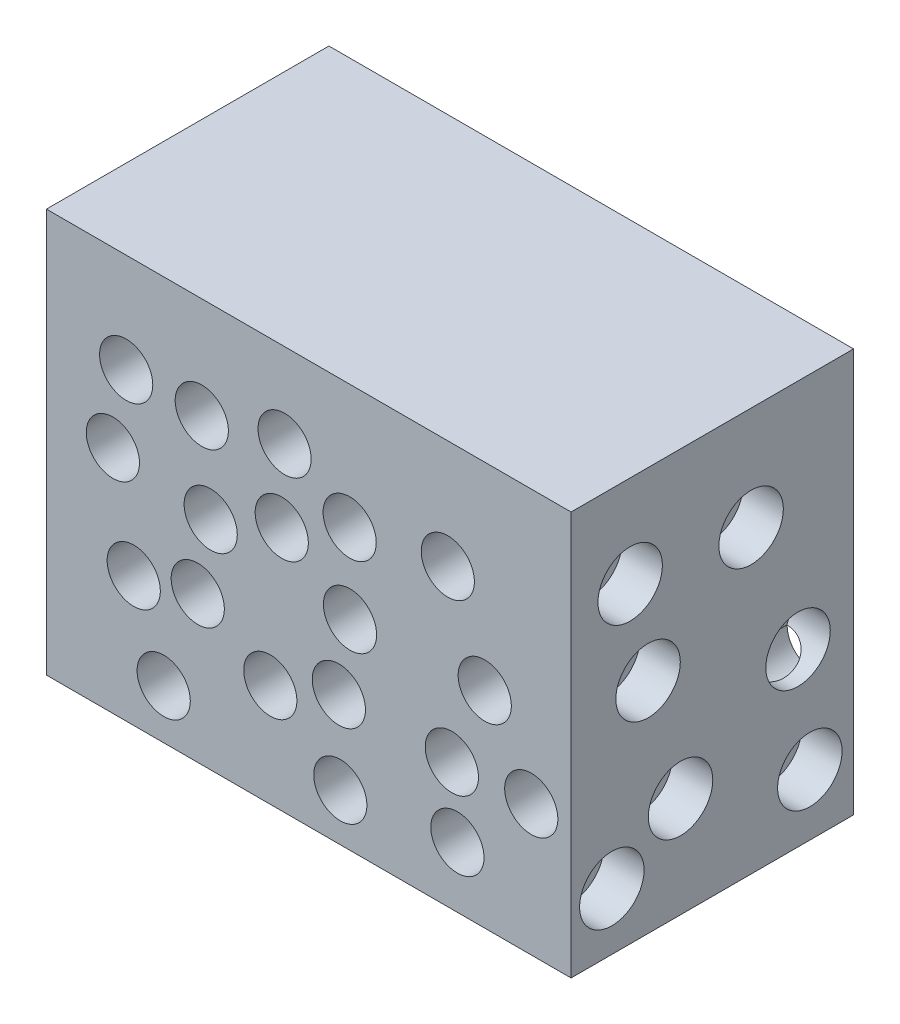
ISO-10303-21;
HEADER;
FILE_DESCRIPTION(('STEP AP214'),'2;1');
FILE_NAME('part.step','',(''),(''),'','','');
FILE_SCHEMA(('AUTOMOTIVE_DESIGN { 1 0 10303 214 1 1 1 1 }'));
ENDSEC;
DATA;
#1=APPLICATION_CONTEXT('core data for automotive mechanical design processes');
#2=APPLICATION_PROTOCOL_DEFINITION('international standard','automotive_design',2000,#1);
#3=PRODUCT_CONTEXT('',#1,'mechanical');
#4=PRODUCT('Part','Part','',(#3));
#5=PRODUCT_RELATED_PRODUCT_CATEGORY('part','',(#4));
#6=PRODUCT_DEFINITION_FORMATION('','',#4);
#7=PRODUCT_DEFINITION_CONTEXT('part definition',#1,'design');
#8=PRODUCT_DEFINITION('design','',#6,#7);
#9=PRODUCT_DEFINITION_SHAPE('','',#8);
#10=(LENGTH_UNIT() NAMED_UNIT(*) SI_UNIT(.MILLI.,.METRE.));
#11=(NAMED_UNIT(*) PLANE_ANGLE_UNIT() SI_UNIT($,.RADIAN.));
#12=(NAMED_UNIT(*) SI_UNIT($,.STERADIAN.) SOLID_ANGLE_UNIT());
#13=UNCERTAINTY_MEASURE_WITH_UNIT(LENGTH_MEASURE(1.E-05),#10,'distance_accuracy_value','');
#14=(GEOMETRIC_REPRESENTATION_CONTEXT(3) GLOBAL_UNCERTAINTY_ASSIGNED_CONTEXT((#13)) GLOBAL_UNIT_ASSIGNED_CONTEXT((#10,
#11,#12)) REPRESENTATION_CONTEXT('',''));
#15=CARTESIAN_POINT('',(0.,0.,0.));
#16=DIRECTION('',(0.,0.,1.));
#17=DIRECTION('',(1.,0.,0.));
#18=AXIS2_PLACEMENT_3D('',#15,#16,#17);
#19=CARTESIAN_POINT('',(-65.,50.,70.));
#20=DIRECTION('',(1.,0.,0.));
#21=DIRECTION('',(0.,1.,0.));
#22=AXIS2_PLACEMENT_3D('',#19,#20,#21);
#23=PLANE('',#22);
#24=DIRECTION('',(0.,-1.,0.));
#25=VECTOR('',#24,1.);
#26=CARTESIAN_POINT('',(-65.,50.,0.));
#27=LINE('',#26,#25);
#28=CARTESIAN_POINT('',(-65.,50.,0.));
#29=VERTEX_POINT('',#28);
#30=CARTESIAN_POINT('',(-65.,-50.,0.));
#31=VERTEX_POINT('',#30);
#32=EDGE_CURVE('E368',#29,#31,#27,.T.);
#33=ORIENTED_EDGE('',*,*,#32,.T.);
#34=DIRECTION('',(0.,0.,-1.));
#35=VECTOR('',#34,1.);
#36=CARTESIAN_POINT('',(-65.,-50.,70.));
#37=LINE('',#36,#35);
#38=CARTESIAN_POINT('',(-65.,-50.,70.));
#39=VERTEX_POINT('',#38);
#40=EDGE_CURVE('E397',#39,#31,#37,.T.);
#41=ORIENTED_EDGE('',*,*,#40,.F.);
#42=DIRECTION('',(0.,-1.,0.));
#43=VECTOR('',#42,1.);
#44=CARTESIAN_POINT('',(-65.,50.,70.));
#45=LINE('',#44,#43);
#46=CARTESIAN_POINT('',(-65.,50.,70.));
#47=VERTEX_POINT('',#46);
#48=EDGE_CURVE('E371',#47,#39,#45,.T.);
#49=ORIENTED_EDGE('',*,*,#48,.F.);
#50=DIRECTION('',(0.,0.,-1.));
#51=VECTOR('',#50,1.);
#52=CARTESIAN_POINT('',(-65.,50.,70.));
#53=LINE('',#52,#51);
#54=EDGE_CURVE('E381',#47,#29,#53,.T.);
#55=ORIENTED_EDGE('',*,*,#54,.T.);
#56=EDGE_LOOP('',(#33,#41,#49,#55));
#57=FACE_BOUND('',#56,.T.);
#58=ADVANCED_FACE('F41',(#57),#23,.F.);
#59=CARTESIAN_POINT('',(-65.,-50.,70.));
#60=DIRECTION('',(0.,1.,0.));
#61=DIRECTION('',(0.,0.,1.));
#62=AXIS2_PLACEMENT_3D('',#59,#60,#61);
#63=PLANE('',#62);
#64=DIRECTION('',(0.,0.,1.));
#65=VECTOR('',#64,1.);
#66=CARTESIAN_POINT('',(50.,-50.,20.0000000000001));
#67=LINE('',#66,#65);
#68=CARTESIAN_POINT('',(50.,-50.,20.0000000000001));
#69=VERTEX_POINT('',#68);
#70=CARTESIAN_POINT('',(50.,-50.,50.));
#71=VERTEX_POINT('',#70);
#72=EDGE_CURVE('E188',#69,#71,#67,.T.);
#73=ORIENTED_EDGE('',*,*,#72,.F.);
#74=CARTESIAN_POINT('',(40.,-50.,20.));
#75=DIRECTION('',(0.,-1.,0.));
#76=DIRECTION('',(0.,0.,-1.));
#77=AXIS2_PLACEMENT_3D('',#74,#75,#76);
#78=CIRCLE('',#77,10.);
#79=CARTESIAN_POINT('',(39.9999999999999,-50.,10.));
#80=VERTEX_POINT('',#79);
#81=EDGE_CURVE('E61',#80,#69,#78,.T.);
#82=ORIENTED_EDGE('',*,*,#81,.F.);
#83=DIRECTION('',(1.,0.,0.));
#84=VECTOR('',#83,1.);
#85=CARTESIAN_POINT('',(-39.9999999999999,-50.,10.));
#86=LINE('',#85,#84);
#87=CARTESIAN_POINT('',(-39.9999999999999,-50.,10.));
#88=VERTEX_POINT('',#87);
#89=EDGE_CURVE('E168',#88,#80,#86,.T.);
#90=ORIENTED_EDGE('',*,*,#89,.F.);
#91=CARTESIAN_POINT('',(-40.,-50.,20.));
#92=DIRECTION('',(0.,-1.,0.));
#93=DIRECTION('',(0.,0.,1.));
#94=AXIS2_PLACEMENT_3D('',#91,#92,#93);
#95=CIRCLE('',#94,10.);
#96=CARTESIAN_POINT('',(-50.,-50.,20.0000000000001));
#97=VERTEX_POINT('',#96);
#98=EDGE_CURVE('E171',#97,#88,#95,.T.);
#99=ORIENTED_EDGE('',*,*,#98,.F.);
#100=DIRECTION('',(0.,0.,-1.));
#101=VECTOR('',#100,1.);
#102=CARTESIAN_POINT('',(-50.,-50.,20.0000000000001));
#103=LINE('',#102,#101);
#104=CARTESIAN_POINT('',(-50.,-50.,49.9999999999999));
#105=VERTEX_POINT('',#104);
#106=EDGE_CURVE('E199',#105,#97,#103,.T.);
#107=ORIENTED_EDGE('',*,*,#106,.F.);
#108=CARTESIAN_POINT('',(-40.,-50.,50.));
#109=DIRECTION('',(0.,-1.,0.));
#110=DIRECTION('',(0.,0.,1.));
#111=AXIS2_PLACEMENT_3D('',#108,#109,#110);
#112=CIRCLE('',#111,10.);
#113=CARTESIAN_POINT('',(-40.,-50.,60.));
#114=VERTEX_POINT('',#113);
#115=EDGE_CURVE('E196',#114,#105,#112,.T.);
#116=ORIENTED_EDGE('',*,*,#115,.F.);
#117=DIRECTION('',(-1.,0.,0.));
#118=VECTOR('',#117,1.);
#119=CARTESIAN_POINT('',(-39.9999999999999,-50.,60.));
#120=LINE('',#119,#118);
#121=CARTESIAN_POINT('',(39.9999999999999,-50.,60.));
#122=VERTEX_POINT('',#121);
#123=EDGE_CURVE('E193',#122,#114,#120,.T.);
#124=ORIENTED_EDGE('',*,*,#123,.F.);
#125=CARTESIAN_POINT('',(40.,-50.,50.));
#126=DIRECTION('',(0.,-1.,0.));
#127=DIRECTION('',(0.,0.,1.));
#128=AXIS2_PLACEMENT_3D('',#125,#126,#127);
#129=CIRCLE('',#128,10.);
#130=EDGE_CURVE('E190',#71,#122,#129,.T.);
#131=ORIENTED_EDGE('',*,*,#130,.F.);
#132=EDGE_LOOP('',(#73,#82,#90,#99,#107,#116,#124,#131));
#133=FACE_BOUND('',#132,.T.);
#134=DIRECTION('',(1.,0.,0.));
#135=VECTOR('',#134,1.);
#136=CARTESIAN_POINT('',(-65.,-50.,0.));
#137=LINE('',#136,#135);
#138=CARTESIAN_POINT('',(65.,-50.,0.));
#139=VERTEX_POINT('',#138);
#140=EDGE_CURVE('E384',#31,#139,#137,.T.);
#141=ORIENTED_EDGE('',*,*,#140,.T.);
#142=DIRECTION('',(0.,0.,-1.));
#143=VECTOR('',#142,1.);
#144=CARTESIAN_POINT('',(65.,-50.,70.));
#145=LINE('',#144,#143);
#146=CARTESIAN_POINT('',(65.,-50.,70.));
#147=VERTEX_POINT('',#146);
#148=EDGE_CURVE('E394',#147,#139,#145,.T.);
#149=ORIENTED_EDGE('',*,*,#148,.F.);
#150=DIRECTION('',(1.,0.,0.));
#151=VECTOR('',#150,1.);
#152=CARTESIAN_POINT('',(-65.,-50.,70.));
#153=LINE('',#152,#151);
#154=EDGE_CURVE('E374',#39,#147,#153,.T.);
#155=ORIENTED_EDGE('',*,*,#154,.F.);
#156=ORIENTED_EDGE('',*,*,#40,.T.);
#157=EDGE_LOOP('',(#141,#149,#155,#156));
#158=FACE_BOUND('',#157,.T.);
#159=ADVANCED_FACE('F470',(#133,#158),#63,.F.);
#160=CARTESIAN_POINT('',(65.,50.,70.));
#161=DIRECTION('',(-1.,0.,0.));
#162=DIRECTION('',(0.,-1.,0.));
#163=AXIS2_PLACEMENT_3D('',#160,#161,#162);
#164=PLANE('',#163);
#165=CARTESIAN_POINT('',(65.,-35.8614575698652,59.8943154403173));
#166=DIRECTION('',(1.,0.,0.));
#167=DIRECTION('',(0.,0.,-1.));
#168=AXIS2_PLACEMENT_3D('',#165,#166,#167);
#169=CIRCLE('',#168,7.98641635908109);
#170=CARTESIAN_POINT('',(65.,-35.8614575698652,51.9078990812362));
#171=VERTEX_POINT('',#170);
#172=EDGE_CURVE('E206',#171,#171,#169,.T.);
#173=ORIENTED_EDGE('',*,*,#172,.F.);
#174=EDGE_LOOP('',(#173));
#175=FACE_BOUND('',#174,.T.);
#176=CARTESIAN_POINT('',(65.,-34.854513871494,10.83761145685));
#177=DIRECTION('',(1.,0.,0.));
#178=DIRECTION('',(0.,0.,-1.));
#179=AXIS2_PLACEMENT_3D('',#176,#177,#178);
#180=CIRCLE('',#179,7.98641635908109);
#181=CARTESIAN_POINT('',(65.,-34.854513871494,2.85119509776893));
#182=VERTEX_POINT('',#181);
#183=EDGE_CURVE('E221',#182,#182,#180,.T.);
#184=ORIENTED_EDGE('',*,*,#183,.F.);
#185=EDGE_LOOP('',(#184));
#186=FACE_BOUND('',#185,.T.);
#187=CARTESIAN_POINT('',(65.,-25.039424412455,42.8720967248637));
#188=DIRECTION('',(1.,0.,0.));
#189=DIRECTION('',(0.,0.,-1.));
#190=AXIS2_PLACEMENT_3D('',#187,#188,#189);
#191=CIRCLE('',#190,7.98641635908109);
#192=CARTESIAN_POINT('',(65.,-25.039424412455,34.8856803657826));
#193=VERTEX_POINT('',#192);
#194=EDGE_CURVE('E227',#193,#193,#191,.T.);
#195=ORIENTED_EDGE('',*,*,#194,.F.);
#196=EDGE_LOOP('',(#195));
#197=FACE_BOUND('',#196,.T.);
#198=CARTESIAN_POINT('',(65.,-7.56924293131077,13.7576801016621));
#199=DIRECTION('',(1.,0.,0.));
#200=DIRECTION('',(0.,0.,-1.));
#201=AXIS2_PLACEMENT_3D('',#198,#199,#200);
#202=CIRCLE('',#201,7.98641635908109);
#203=CARTESIAN_POINT('',(65.,-7.56924293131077,5.77126374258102));
#204=VERTEX_POINT('',#203);
#205=EDGE_CURVE('E231',#204,#204,#202,.T.);
#206=ORIENTED_EDGE('',*,*,#205,.F.);
#207=EDGE_LOOP('',(#206));
#208=FACE_BOUND('',#207,.T.);
#209=CARTESIAN_POINT('',(65.,24.385732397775,25.3855255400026));
#210=DIRECTION('',(1.,0.,0.));
#211=DIRECTION('',(0.,0.,-1.));
#212=AXIS2_PLACEMENT_3D('',#209,#210,#211);
#213=CIRCLE('',#212,7.98641635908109);
#214=CARTESIAN_POINT('',(65.,24.385732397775,17.3991091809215));
#215=VERTEX_POINT('',#214);
#216=EDGE_CURVE('E236',#215,#215,#213,.T.);
#217=ORIENTED_EDGE('',*,*,#216,.F.);
#218=EDGE_LOOP('',(#217));
#219=FACE_BOUND('',#218,.T.);
#220=CARTESIAN_POINT('',(65.,4.27393314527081,50.9186841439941));
#221=DIRECTION('',(1.,0.,0.));
#222=DIRECTION('',(0.,0.,-1.));
#223=AXIS2_PLACEMENT_3D('',#220,#221,#222);
#224=CIRCLE('',#223,7.98641635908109);
#225=CARTESIAN_POINT('',(65.,4.27393314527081,42.932267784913));
#226=VERTEX_POINT('',#225);
#227=EDGE_CURVE('E242',#226,#226,#224,.T.);
#228=ORIENTED_EDGE('',*,*,#227,.F.);
#229=EDGE_LOOP('',(#228));
#230=FACE_BOUND('',#229,.T.);
#231=CARTESIAN_POINT('',(65.,27.2613643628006,55.3593241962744));
#232=DIRECTION('',(1.,0.,0.));
#233=DIRECTION('',(0.,0.,-1.));
#234=AXIS2_PLACEMENT_3D('',#231,#232,#233);
#235=CIRCLE('',#234,7.98641635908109);
#236=CARTESIAN_POINT('',(65.,27.2613643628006,47.3729078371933));
#237=VERTEX_POINT('',#236);
#238=EDGE_CURVE('E248',#237,#237,#235,.T.);
#239=ORIENTED_EDGE('',*,*,#238,.F.);
#240=EDGE_LOOP('',(#239));
#241=FACE_BOUND('',#240,.T.);
#242=DIRECTION('',(0.,1.,0.));
#243=VECTOR('',#242,1.);
#244=CARTESIAN_POINT('',(65.,50.,0.));
#245=LINE('',#244,#243);
#246=CARTESIAN_POINT('',(65.,50.,0.));
#247=VERTEX_POINT('',#246);
#248=EDGE_CURVE('E386',#139,#247,#245,.T.);
#249=ORIENTED_EDGE('',*,*,#248,.T.);
#250=DIRECTION('',(0.,0.,-1.));
#251=VECTOR('',#250,1.);
#252=CARTESIAN_POINT('',(65.,50.,70.));
#253=LINE('',#252,#251);
#254=CARTESIAN_POINT('',(65.,50.,70.));
#255=VERTEX_POINT('',#254);
#256=EDGE_CURVE('E391',#255,#247,#253,.T.);
#257=ORIENTED_EDGE('',*,*,#256,.F.);
#258=DIRECTION('',(0.,1.,0.));
#259=VECTOR('',#258,1.);
#260=CARTESIAN_POINT('',(65.,50.,70.));
#261=LINE('',#260,#259);
#262=EDGE_CURVE('E377',#147,#255,#261,.T.);
#263=ORIENTED_EDGE('',*,*,#262,.F.);
#264=ORIENTED_EDGE('',*,*,#148,.T.);
#265=EDGE_LOOP('',(#249,#257,#263,#264));
#266=FACE_BOUND('',#265,.T.);
#267=ADVANCED_FACE('F475',(#175,#186,#197,#208,#219,#230,#241,#266),#164,.F.);
#268=CARTESIAN_POINT('',(-65.,50.,70.));
#269=DIRECTION('',(0.,-1.,0.));
#270=DIRECTION('',(0.,0.,-1.));
#271=AXIS2_PLACEMENT_3D('',#268,#269,#270);
#272=PLANE('',#271);
#273=DIRECTION('',(-1.,0.,0.));
#274=VECTOR('',#273,1.);
#275=CARTESIAN_POINT('',(-65.,50.,0.));
#276=LINE('',#275,#274);
#277=EDGE_CURVE('E375',#247,#29,#276,.T.);
#278=ORIENTED_EDGE('',*,*,#277,.T.);
#279=ORIENTED_EDGE('',*,*,#54,.F.);
#280=DIRECTION('',(-1.,0.,0.));
#281=VECTOR('',#280,1.);
#282=CARTESIAN_POINT('',(-65.,50.,70.));
#283=LINE('',#282,#281);
#284=EDGE_CURVE('E379',#255,#47,#283,.T.);
#285=ORIENTED_EDGE('',*,*,#284,.F.);
#286=ORIENTED_EDGE('',*,*,#256,.T.);
#287=EDGE_LOOP('',(#278,#279,#285,#286));
#288=FACE_BOUND('',#287,.T.);
#289=ADVANCED_FACE('F493',(#288),#272,.F.);
#290=CARTESIAN_POINT('',(-65.,-50.,70.));
#291=DIRECTION('',(0.,0.,1.));
#292=DIRECTION('',(1.,0.,0.));
#293=AXIS2_PLACEMENT_3D('',#290,#291,#292);
#294=PLANE('',#293);
#295=CARTESIAN_POINT('',(-6.68865409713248,10.7974576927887,70.));
#296=DIRECTION('',(0.,0.,1.));
#297=DIRECTION('',(1.,0.,0.));
#298=AXIS2_PLACEMENT_3D('',#295,#296,#297);
#299=CIRCLE('',#298,6.59093137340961);
#300=CARTESIAN_POINT('',(-0.0977227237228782,10.7974576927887,70.));
#301=VERTEX_POINT('',#300);
#302=EDGE_CURVE('E254',#301,#301,#299,.T.);
#303=ORIENTED_EDGE('',*,*,#302,.F.);
#304=EDGE_LOOP('',(#303));
#305=FACE_BOUND('',#304,.T.);
#306=CARTESIAN_POINT('',(-26.5022954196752,24.9184546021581,70.));
#307=DIRECTION('',(0.,0.,1.));
#308=DIRECTION('',(1.,0.,0.));
#309=AXIS2_PLACEMENT_3D('',#306,#307,#308);
#310=CIRCLE('',#309,6.59093137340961);
#311=CARTESIAN_POINT('',(-19.9113640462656,24.9184546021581,70.));
#312=VERTEX_POINT('',#311);
#313=EDGE_CURVE('E260',#312,#312,#310,.T.);
#314=ORIENTED_EDGE('',*,*,#313,.F.);
#315=EDGE_LOOP('',(#314));
#316=FACE_BOUND('',#315,.T.);
#317=CARTESIAN_POINT('',(-48.5394911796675,7.03601100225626,70.));
#318=DIRECTION('',(0.,0.,1.));
#319=DIRECTION('',(1.,0.,0.));
#320=AXIS2_PLACEMENT_3D('',#317,#318,#319);
#321=CIRCLE('',#320,6.59093137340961);
#322=CARTESIAN_POINT('',(-41.9485598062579,7.03601100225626,70.));
#323=VERTEX_POINT('',#322);
#324=EDGE_CURVE('E266',#323,#323,#321,.T.);
#325=ORIENTED_EDGE('',*,*,#324,.F.);
#326=EDGE_LOOP('',(#325));
#327=FACE_BOUND('',#326,.T.);
#328=CARTESIAN_POINT('',(-27.5023763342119,-13.7990845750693,70.));
#329=DIRECTION('',(0.,0.,1.));
#330=DIRECTION('',(1.,0.,0.));
#331=AXIS2_PLACEMENT_3D('',#328,#329,#330);
#332=CIRCLE('',#331,6.59093137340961);
#333=CARTESIAN_POINT('',(-20.9114449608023,-13.7990845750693,70.));
#334=VERTEX_POINT('',#333);
#335=EDGE_CURVE('E272',#334,#334,#332,.T.);
#336=ORIENTED_EDGE('',*,*,#335,.F.);
#337=EDGE_LOOP('',(#336));
#338=FACE_BOUND('',#337,.T.);
#339=CARTESIAN_POINT('',(7.46027598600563,-17.944584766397,70.));
#340=DIRECTION('',(0.,0.,1.));
#341=DIRECTION('',(1.,0.,0.));
#342=AXIS2_PLACEMENT_3D('',#339,#340,#341);
#343=CIRCLE('',#342,6.59093137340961);
#344=CARTESIAN_POINT('',(14.0512073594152,-17.944584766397,70.));
#345=VERTEX_POINT('',#344);
#346=EDGE_CURVE('E278',#345,#345,#343,.T.);
#347=ORIENTED_EDGE('',*,*,#346,.F.);
#348=EDGE_LOOP('',(#347));
#349=FACE_BOUND('',#348,.T.);
#350=CARTESIAN_POINT('',(55.1389570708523,-17.5543070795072,70.));
#351=DIRECTION('',(0.,0.,1.));
#352=DIRECTION('',(1.,0.,0.));
#353=AXIS2_PLACEMENT_3D('',#350,#351,#352);
#354=CIRCLE('',#353,6.59093137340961);
#355=CARTESIAN_POINT('',(61.7298884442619,-17.5543070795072,70.));
#356=VERTEX_POINT('',#355);
#357=EDGE_CURVE('E284',#356,#356,#354,.T.);
#358=ORIENTED_EDGE('',*,*,#357,.F.);
#359=EDGE_LOOP('',(#358));
#360=FACE_BOUND('',#359,.T.);
#361=CARTESIAN_POINT('',(36.8368423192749,-34.9862285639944,70.));
#362=DIRECTION('',(0.,0.,1.));
#363=DIRECTION('',(1.,0.,0.));
#364=AXIS2_PLACEMENT_3D('',#361,#362,#363);
#365=CIRCLE('',#364,6.59093137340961);
#366=CARTESIAN_POINT('',(43.4277736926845,-34.9862285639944,70.));
#367=VERTEX_POINT('',#366);
#368=EDGE_CURVE('E290',#367,#367,#365,.T.);
#369=ORIENTED_EDGE('',*,*,#368,.F.);
#370=EDGE_LOOP('',(#369));
#371=FACE_BOUND('',#370,.T.);
#372=CARTESIAN_POINT('',(-35.9417596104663,-37.7607543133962,70.));
#373=DIRECTION('',(0.,0.,1.));
#374=DIRECTION('',(1.,0.,0.));
#375=AXIS2_PLACEMENT_3D('',#372,#373,#374);
#376=CIRCLE('',#375,6.59093137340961);
#377=CARTESIAN_POINT('',(-29.3508282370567,-37.7607543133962,70.));
#378=VERTEX_POINT('',#377);
#379=EDGE_CURVE('E296',#378,#378,#376,.T.);
#380=ORIENTED_EDGE('',*,*,#379,.F.);
#381=EDGE_LOOP('',(#380));
#382=FACE_BOUND('',#381,.T.);
#383=CARTESIAN_POINT('',(7.81740116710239,-38.272100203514,70.));
#384=DIRECTION('',(0.,0.,1.));
#385=DIRECTION('',(1.,0.,0.));
#386=AXIS2_PLACEMENT_3D('',#383,#384,#385);
#387=CIRCLE('',#386,6.59093137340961);
#388=CARTESIAN_POINT('',(14.408332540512,-38.272100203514,70.));
#389=VERTEX_POINT('',#388);
#390=EDGE_CURVE('E302',#389,#389,#387,.T.);
#391=ORIENTED_EDGE('',*,*,#390,.F.);
#392=EDGE_LOOP('',(#391));
#393=FACE_BOUND('',#392,.T.);
#394=CARTESIAN_POINT('',(43.6118602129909,0.997041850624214,70.));
#395=DIRECTION('',(0.,0.,1.));
#396=DIRECTION('',(1.,0.,0.));
#397=AXIS2_PLACEMENT_3D('',#394,#395,#396);
#398=CIRCLE('',#397,6.59093137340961);
#399=CARTESIAN_POINT('',(50.2027915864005,0.997041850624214,70.));
#400=VERTEX_POINT('',#399);
#401=EDGE_CURVE('E308',#400,#400,#398,.T.);
#402=ORIENTED_EDGE('',*,*,#401,.F.);
#403=EDGE_LOOP('',(#402));
#404=FACE_BOUND('',#403,.T.);
#405=CARTESIAN_POINT('',(10.1394168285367,19.2600628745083,70.));
#406=DIRECTION('',(0.,0.,1.));
#407=DIRECTION('',(1.,0.,0.));
#408=AXIS2_PLACEMENT_3D('',#405,#406,#407);
#409=CIRCLE('',#408,6.59093137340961);
#410=CARTESIAN_POINT('',(16.7303482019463,19.2600628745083,70.));
#411=VERTEX_POINT('',#410);
#412=EDGE_CURVE('E314',#411,#411,#409,.T.);
#413=ORIENTED_EDGE('',*,*,#412,.F.);
#414=EDGE_LOOP('',(#413));
#415=FACE_BOUND('',#414,.T.);
#416=CARTESIAN_POINT('',(34.4567560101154,23.050907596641,70.));
#417=DIRECTION('',(0.,0.,1.));
#418=DIRECTION('',(1.,0.,0.));
#419=AXIS2_PLACEMENT_3D('',#416,#417,#418);
#420=CIRCLE('',#419,6.59093137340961);
#421=CARTESIAN_POINT('',(41.047687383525,23.050907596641,70.));
#422=VERTEX_POINT('',#421);
#423=EDGE_CURVE('E320',#422,#422,#420,.T.);
#424=ORIENTED_EDGE('',*,*,#423,.F.);
#425=EDGE_LOOP('',(#424));
#426=FACE_BOUND('',#425,.T.);
#427=CARTESIAN_POINT('',(35.4612597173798,-18.4268222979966,70.));
#428=DIRECTION('',(0.,0.,1.));
#429=DIRECTION('',(1.,0.,0.));
#430=AXIS2_PLACEMENT_3D('',#427,#428,#429);
#431=CIRCLE('',#430,6.59093137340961);
#432=CARTESIAN_POINT('',(42.0521910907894,-18.4268222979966,70.));
#433=VERTEX_POINT('',#432);
#434=EDGE_CURVE('E326',#433,#433,#431,.T.);
#435=ORIENTED_EDGE('',*,*,#434,.F.);
#436=EDGE_LOOP('',(#435));
#437=FACE_BOUND('',#436,.T.);
#438=CARTESIAN_POINT('',(-9.52651600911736,-24.4964892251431,70.));
#439=DIRECTION('',(0.,0.,1.));
#440=DIRECTION('',(1.,0.,0.));
#441=AXIS2_PLACEMENT_3D('',#438,#439,#440);
#442=CIRCLE('',#441,6.59093137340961);
#443=CARTESIAN_POINT('',(-2.93558463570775,-24.4964892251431,70.));
#444=VERTEX_POINT('',#443);
#445=EDGE_CURVE('E332',#444,#444,#442,.T.);
#446=ORIENTED_EDGE('',*,*,#445,.F.);
#447=EDGE_LOOP('',(#446));
#448=FACE_BOUND('',#447,.T.);
#449=CARTESIAN_POINT('',(10.2239243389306,-0.457053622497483,70.));
#450=DIRECTION('',(0.,0.,1.));
#451=DIRECTION('',(1.,0.,0.));
#452=AXIS2_PLACEMENT_3D('',#449,#450,#451);
#453=CIRCLE('',#452,6.59093137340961);
#454=CARTESIAN_POINT('',(16.8148557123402,-0.457053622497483,70.));
#455=VERTEX_POINT('',#454);
#456=EDGE_CURVE('E338',#455,#455,#453,.T.);
#457=ORIENTED_EDGE('',*,*,#456,.F.);
#458=EDGE_LOOP('',(#457));
#459=FACE_BOUND('',#458,.T.);
#460=CARTESIAN_POINT('',(-43.3648968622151,-17.8566803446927,70.));
#461=DIRECTION('',(0.,0.,1.));
#462=DIRECTION('',(1.,0.,0.));
#463=AXIS2_PLACEMENT_3D('',#460,#461,#462);
#464=CIRCLE('',#463,6.59093137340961);
#465=CARTESIAN_POINT('',(-36.7739654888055,-17.8566803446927,70.));
#466=VERTEX_POINT('',#465);
#467=EDGE_CURVE('E344',#466,#466,#464,.T.);
#468=ORIENTED_EDGE('',*,*,#467,.F.);
#469=EDGE_LOOP('',(#468));
#470=FACE_BOUND('',#469,.T.);
#471=CARTESIAN_POINT('',(-5.99057994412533,29.1079775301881,70.));
#472=DIRECTION('',(0.,0.,1.));
#473=DIRECTION('',(1.,0.,0.));
#474=AXIS2_PLACEMENT_3D('',#471,#472,#473);
#475=CIRCLE('',#474,6.59093137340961);
#476=CARTESIAN_POINT('',(0.600351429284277,29.1079775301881,70.));
#477=VERTEX_POINT('',#476);
#478=EDGE_CURVE('E350',#477,#477,#475,.T.);
#479=ORIENTED_EDGE('',*,*,#478,.F.);
#480=EDGE_LOOP('',(#479));
#481=FACE_BOUND('',#480,.T.);
#482=CARTESIAN_POINT('',(-24.2993066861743,3.74144917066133,70.));
#483=DIRECTION('',(0.,0.,1.));
#484=DIRECTION('',(1.,0.,0.));
#485=AXIS2_PLACEMENT_3D('',#482,#483,#484);
#486=CIRCLE('',#485,6.59093137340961);
#487=CARTESIAN_POINT('',(-17.7083753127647,3.74144917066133,70.));
#488=VERTEX_POINT('',#487);
#489=EDGE_CURVE('E356',#488,#488,#486,.T.);
#490=ORIENTED_EDGE('',*,*,#489,.F.);
#491=EDGE_LOOP('',(#490));
#492=FACE_BOUND('',#491,.T.);
#493=CARTESIAN_POINT('',(-45.2419782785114,25.4152282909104,70.));
#494=DIRECTION('',(0.,0.,1.));
#495=DIRECTION('',(1.,0.,0.));
#496=AXIS2_PLACEMENT_3D('',#493,#494,#495);
#497=CIRCLE('',#496,6.59093137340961);
#498=CARTESIAN_POINT('',(-38.6510469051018,25.4152282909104,70.));
#499=VERTEX_POINT('',#498);
#500=EDGE_CURVE('E362',#499,#499,#497,.T.);
#501=ORIENTED_EDGE('',*,*,#500,.F.);
#502=EDGE_LOOP('',(#501));
#503=FACE_BOUND('',#502,.T.);
#504=ORIENTED_EDGE('',*,*,#48,.T.);
#505=ORIENTED_EDGE('',*,*,#154,.T.);
#506=ORIENTED_EDGE('',*,*,#262,.T.);
#507=ORIENTED_EDGE('',*,*,#284,.T.);
#508=EDGE_LOOP('',(#504,#505,#506,#507));
#509=FACE_BOUND('',#508,.T.);
#510=ADVANCED_FACE('F489',(#305,#316,#327,#338,#349,#360,#371,#382,#393,#404,#415,#426,#437,
#448,#459,#470,#481,#492,#503,#509),#294,.T.);
#511=CARTESIAN_POINT('',(-65.,-50.,0.));
#512=DIRECTION('',(0.,0.,1.));
#513=DIRECTION('',(1.,0.,0.));
#514=AXIS2_PLACEMENT_3D('',#511,#512,#513);
#515=PLANE('',#514);
#516=CARTESIAN_POINT('',(-6.68865409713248,10.7974576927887,0.));
#517=DIRECTION('',(0.,0.,1.));
#518=DIRECTION('',(1.,0.,0.));
#519=AXIS2_PLACEMENT_3D('',#516,#517,#518);
#520=CIRCLE('',#519,6.59093137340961);
#521=CARTESIAN_POINT('',(-0.0977227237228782,10.7974576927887,0.));
#522=VERTEX_POINT('',#521);
#523=EDGE_CURVE('E257',#522,#522,#520,.T.);
#524=ORIENTED_EDGE('',*,*,#523,.T.);
#525=EDGE_LOOP('',(#524));
#526=FACE_BOUND('',#525,.T.);
#527=CARTESIAN_POINT('',(-26.5022954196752,24.9184546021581,0.));
#528=DIRECTION('',(0.,0.,1.));
#529=DIRECTION('',(1.,0.,0.));
#530=AXIS2_PLACEMENT_3D('',#527,#528,#529);
#531=CIRCLE('',#530,6.59093137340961);
#532=CARTESIAN_POINT('',(-19.9113640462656,24.9184546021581,0.));
#533=VERTEX_POINT('',#532);
#534=EDGE_CURVE('E263',#533,#533,#531,.T.);
#535=ORIENTED_EDGE('',*,*,#534,.T.);
#536=EDGE_LOOP('',(#535));
#537=FACE_BOUND('',#536,.T.);
#538=CARTESIAN_POINT('',(-48.5394911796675,7.03601100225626,0.));
#539=DIRECTION('',(0.,0.,1.));
#540=DIRECTION('',(1.,0.,0.));
#541=AXIS2_PLACEMENT_3D('',#538,#539,#540);
#542=CIRCLE('',#541,6.59093137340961);
#543=CARTESIAN_POINT('',(-41.9485598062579,7.03601100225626,0.));
#544=VERTEX_POINT('',#543);
#545=EDGE_CURVE('E269',#544,#544,#542,.T.);
#546=ORIENTED_EDGE('',*,*,#545,.T.);
#547=EDGE_LOOP('',(#546));
#548=FACE_BOUND('',#547,.T.);
#549=CARTESIAN_POINT('',(-27.5023763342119,-13.7990845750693,0.));
#550=DIRECTION('',(0.,0.,1.));
#551=DIRECTION('',(1.,0.,0.));
#552=AXIS2_PLACEMENT_3D('',#549,#550,#551);
#553=CIRCLE('',#552,6.59093137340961);
#554=CARTESIAN_POINT('',(-20.9114449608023,-13.7990845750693,0.));
#555=VERTEX_POINT('',#554);
#556=EDGE_CURVE('E275',#555,#555,#553,.T.);
#557=ORIENTED_EDGE('',*,*,#556,.T.);
#558=EDGE_LOOP('',(#557));
#559=FACE_BOUND('',#558,.T.);
#560=CARTESIAN_POINT('',(7.46027598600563,-17.944584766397,0.));
#561=DIRECTION('',(0.,0.,1.));
#562=DIRECTION('',(1.,0.,0.));
#563=AXIS2_PLACEMENT_3D('',#560,#561,#562);
#564=CIRCLE('',#563,6.59093137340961);
#565=CARTESIAN_POINT('',(14.0512073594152,-17.944584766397,0.));
#566=VERTEX_POINT('',#565);
#567=EDGE_CURVE('E281',#566,#566,#564,.T.);
#568=ORIENTED_EDGE('',*,*,#567,.T.);
#569=EDGE_LOOP('',(#568));
#570=FACE_BOUND('',#569,.T.);
#571=CARTESIAN_POINT('',(55.1389570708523,-17.5543070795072,0.));
#572=DIRECTION('',(0.,0.,1.));
#573=DIRECTION('',(1.,0.,0.));
#574=AXIS2_PLACEMENT_3D('',#571,#572,#573);
#575=CIRCLE('',#574,6.59093137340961);
#576=CARTESIAN_POINT('',(61.7298884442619,-17.5543070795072,0.));
#577=VERTEX_POINT('',#576);
#578=EDGE_CURVE('E287',#577,#577,#575,.T.);
#579=ORIENTED_EDGE('',*,*,#578,.T.);
#580=EDGE_LOOP('',(#579));
#581=FACE_BOUND('',#580,.T.);
#582=CARTESIAN_POINT('',(36.8368423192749,-34.9862285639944,0.));
#583=DIRECTION('',(0.,0.,1.));
#584=DIRECTION('',(1.,0.,0.));
#585=AXIS2_PLACEMENT_3D('',#582,#583,#584);
#586=CIRCLE('',#585,6.59093137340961);
#587=CARTESIAN_POINT('',(43.4277736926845,-34.9862285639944,0.));
#588=VERTEX_POINT('',#587);
#589=EDGE_CURVE('E293',#588,#588,#586,.T.);
#590=ORIENTED_EDGE('',*,*,#589,.T.);
#591=EDGE_LOOP('',(#590));
#592=FACE_BOUND('',#591,.T.);
#593=CARTESIAN_POINT('',(-35.9417596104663,-37.7607543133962,0.));
#594=DIRECTION('',(0.,0.,1.));
#595=DIRECTION('',(1.,0.,0.));
#596=AXIS2_PLACEMENT_3D('',#593,#594,#595);
#597=CIRCLE('',#596,6.59093137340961);
#598=CARTESIAN_POINT('',(-29.3508282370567,-37.7607543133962,0.));
#599=VERTEX_POINT('',#598);
#600=EDGE_CURVE('E299',#599,#599,#597,.T.);
#601=ORIENTED_EDGE('',*,*,#600,.T.);
#602=EDGE_LOOP('',(#601));
#603=FACE_BOUND('',#602,.T.);
#604=CARTESIAN_POINT('',(7.81740116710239,-38.272100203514,0.));
#605=DIRECTION('',(0.,0.,1.));
#606=DIRECTION('',(1.,0.,0.));
#607=AXIS2_PLACEMENT_3D('',#604,#605,#606);
#608=CIRCLE('',#607,6.59093137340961);
#609=CARTESIAN_POINT('',(14.408332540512,-38.272100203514,0.));
#610=VERTEX_POINT('',#609);
#611=EDGE_CURVE('E305',#610,#610,#608,.T.);
#612=ORIENTED_EDGE('',*,*,#611,.T.);
#613=EDGE_LOOP('',(#612));
#614=FACE_BOUND('',#613,.T.);
#615=CARTESIAN_POINT('',(43.6118602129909,0.997041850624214,0.));
#616=DIRECTION('',(0.,0.,1.));
#617=DIRECTION('',(1.,0.,0.));
#618=AXIS2_PLACEMENT_3D('',#615,#616,#617);
#619=CIRCLE('',#618,6.59093137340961);
#620=CARTESIAN_POINT('',(50.2027915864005,0.997041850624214,0.));
#621=VERTEX_POINT('',#620);
#622=EDGE_CURVE('E311',#621,#621,#619,.T.);
#623=ORIENTED_EDGE('',*,*,#622,.T.);
#624=EDGE_LOOP('',(#623));
#625=FACE_BOUND('',#624,.T.);
#626=CARTESIAN_POINT('',(10.1394168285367,19.2600628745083,0.));
#627=DIRECTION('',(0.,0.,1.));
#628=DIRECTION('',(1.,0.,0.));
#629=AXIS2_PLACEMENT_3D('',#626,#627,#628);
#630=CIRCLE('',#629,6.59093137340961);
#631=CARTESIAN_POINT('',(16.7303482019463,19.2600628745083,0.));
#632=VERTEX_POINT('',#631);
#633=EDGE_CURVE('E317',#632,#632,#630,.T.);
#634=ORIENTED_EDGE('',*,*,#633,.T.);
#635=EDGE_LOOP('',(#634));
#636=FACE_BOUND('',#635,.T.);
#637=CARTESIAN_POINT('',(34.4567560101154,23.050907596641,0.));
#638=DIRECTION('',(0.,0.,1.));
#639=DIRECTION('',(1.,0.,0.));
#640=AXIS2_PLACEMENT_3D('',#637,#638,#639);
#641=CIRCLE('',#640,6.59093137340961);
#642=CARTESIAN_POINT('',(41.047687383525,23.050907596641,0.));
#643=VERTEX_POINT('',#642);
#644=EDGE_CURVE('E323',#643,#643,#641,.T.);
#645=ORIENTED_EDGE('',*,*,#644,.T.);
#646=EDGE_LOOP('',(#645));
#647=FACE_BOUND('',#646,.T.);
#648=CARTESIAN_POINT('',(35.4612597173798,-18.4268222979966,0.));
#649=DIRECTION('',(0.,0.,1.));
#650=DIRECTION('',(1.,0.,0.));
#651=AXIS2_PLACEMENT_3D('',#648,#649,#650);
#652=CIRCLE('',#651,6.59093137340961);
#653=CARTESIAN_POINT('',(42.0521910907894,-18.4268222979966,0.));
#654=VERTEX_POINT('',#653);
#655=EDGE_CURVE('E329',#654,#654,#652,.T.);
#656=ORIENTED_EDGE('',*,*,#655,.T.);
#657=EDGE_LOOP('',(#656));
#658=FACE_BOUND('',#657,.T.);
#659=CARTESIAN_POINT('',(-9.52651600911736,-24.4964892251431,0.));
#660=DIRECTION('',(0.,0.,1.));
#661=DIRECTION('',(1.,0.,0.));
#662=AXIS2_PLACEMENT_3D('',#659,#660,#661);
#663=CIRCLE('',#662,6.59093137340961);
#664=CARTESIAN_POINT('',(-2.93558463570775,-24.4964892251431,0.));
#665=VERTEX_POINT('',#664);
#666=EDGE_CURVE('E335',#665,#665,#663,.T.);
#667=ORIENTED_EDGE('',*,*,#666,.T.);
#668=EDGE_LOOP('',(#667));
#669=FACE_BOUND('',#668,.T.);
#670=CARTESIAN_POINT('',(10.2239243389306,-0.457053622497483,0.));
#671=DIRECTION('',(0.,0.,1.));
#672=DIRECTION('',(1.,0.,0.));
#673=AXIS2_PLACEMENT_3D('',#670,#671,#672);
#674=CIRCLE('',#673,6.59093137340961);
#675=CARTESIAN_POINT('',(16.8148557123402,-0.457053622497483,0.));
#676=VERTEX_POINT('',#675);
#677=EDGE_CURVE('E341',#676,#676,#674,.T.);
#678=ORIENTED_EDGE('',*,*,#677,.T.);
#679=EDGE_LOOP('',(#678));
#680=FACE_BOUND('',#679,.T.);
#681=CARTESIAN_POINT('',(-43.3648968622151,-17.8566803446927,0.));
#682=DIRECTION('',(0.,0.,1.));
#683=DIRECTION('',(1.,0.,0.));
#684=AXIS2_PLACEMENT_3D('',#681,#682,#683);
#685=CIRCLE('',#684,6.59093137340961);
#686=CARTESIAN_POINT('',(-36.7739654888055,-17.8566803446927,0.));
#687=VERTEX_POINT('',#686);
#688=EDGE_CURVE('E347',#687,#687,#685,.T.);
#689=ORIENTED_EDGE('',*,*,#688,.T.);
#690=EDGE_LOOP('',(#689));
#691=FACE_BOUND('',#690,.T.);
#692=CARTESIAN_POINT('',(-5.99057994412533,29.1079775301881,0.));
#693=DIRECTION('',(0.,0.,1.));
#694=DIRECTION('',(1.,0.,0.));
#695=AXIS2_PLACEMENT_3D('',#692,#693,#694);
#696=CIRCLE('',#695,6.59093137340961);
#697=CARTESIAN_POINT('',(0.600351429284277,29.1079775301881,0.));
#698=VERTEX_POINT('',#697);
#699=EDGE_CURVE('E353',#698,#698,#696,.T.);
#700=ORIENTED_EDGE('',*,*,#699,.T.);
#701=EDGE_LOOP('',(#700));
#702=FACE_BOUND('',#701,.T.);
#703=CARTESIAN_POINT('',(-24.2993066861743,3.74144917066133,0.));
#704=DIRECTION('',(0.,0.,1.));
#705=DIRECTION('',(1.,0.,0.));
#706=AXIS2_PLACEMENT_3D('',#703,#704,#705);
#707=CIRCLE('',#706,6.59093137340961);
#708=CARTESIAN_POINT('',(-17.7083753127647,3.74144917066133,0.));
#709=VERTEX_POINT('',#708);
#710=EDGE_CURVE('E359',#709,#709,#707,.T.);
#711=ORIENTED_EDGE('',*,*,#710,.T.);
#712=EDGE_LOOP('',(#711));
#713=FACE_BOUND('',#712,.T.);
#714=CARTESIAN_POINT('',(-45.2419782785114,25.4152282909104,0.));
#715=DIRECTION('',(0.,0.,1.));
#716=DIRECTION('',(1.,0.,0.));
#717=AXIS2_PLACEMENT_3D('',#714,#715,#716);
#718=CIRCLE('',#717,6.59093137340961);
#719=CARTESIAN_POINT('',(-38.6510469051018,25.4152282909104,0.));
#720=VERTEX_POINT('',#719);
#721=EDGE_CURVE('E365',#720,#720,#718,.T.);
#722=ORIENTED_EDGE('',*,*,#721,.T.);
#723=EDGE_LOOP('',(#722));
#724=FACE_BOUND('',#723,.T.);
#725=ORIENTED_EDGE('',*,*,#32,.F.);
#726=ORIENTED_EDGE('',*,*,#277,.F.);
#727=ORIENTED_EDGE('',*,*,#248,.F.);
#728=ORIENTED_EDGE('',*,*,#140,.F.);
#729=EDGE_LOOP('',(#725,#726,#727,#728));
#730=FACE_BOUND('',#729,.T.);
#731=ADVANCED_FACE('F483',(#526,#537,#548,#559,#570,#581,#592,#603,#614,#625,#636,#647,#658,
#669,#680,#691,#702,#713,#724,#730),#515,.F.);
#732=CARTESIAN_POINT('',(-45.2419782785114,25.4152282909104,0.));
#733=DIRECTION('',(0.,0.,1.));
#734=DIRECTION('',(1.,0.,0.));
#735=AXIS2_PLACEMENT_3D('',#732,#733,#734);
#736=CYLINDRICAL_SURFACE('',#735,6.59093137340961);
#737=ORIENTED_EDGE('',*,*,#721,.F.);
#738=EDGE_LOOP('',(#737));
#739=FACE_BOUND('',#738,.T.);
#740=ORIENTED_EDGE('',*,*,#500,.T.);
#741=EDGE_LOOP('',(#740));
#742=FACE_BOUND('',#741,.T.);
#743=ADVANCED_FACE('F507',(#739,#742),#736,.F.);
#744=CARTESIAN_POINT('',(-24.2993066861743,3.74144917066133,0.));
#745=DIRECTION('',(0.,0.,1.));
#746=DIRECTION('',(1.,0.,0.));
#747=AXIS2_PLACEMENT_3D('',#744,#745,#746);
#748=CYLINDRICAL_SURFACE('',#747,6.59093137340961);
#749=ORIENTED_EDGE('',*,*,#710,.F.);
#750=EDGE_LOOP('',(#749));
#751=FACE_BOUND('',#750,.T.);
#752=ORIENTED_EDGE('',*,*,#489,.T.);
#753=EDGE_LOOP('',(#752));
#754=FACE_BOUND('',#753,.T.);
#755=ADVANCED_FACE('F514',(#751,#754),#748,.F.);
#756=CARTESIAN_POINT('',(-5.99057994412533,29.1079775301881,0.));
#757=DIRECTION('',(0.,0.,1.));
#758=DIRECTION('',(1.,0.,0.));
#759=AXIS2_PLACEMENT_3D('',#756,#757,#758);
#760=CYLINDRICAL_SURFACE('',#759,6.59093137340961);
#761=ORIENTED_EDGE('',*,*,#699,.F.);
#762=EDGE_LOOP('',(#761));
#763=FACE_BOUND('',#762,.T.);
#764=ORIENTED_EDGE('',*,*,#478,.T.);
#765=EDGE_LOOP('',(#764));
#766=FACE_BOUND('',#765,.T.);
#767=ADVANCED_FACE('F518',(#763,#766),#760,.F.);
#768=CARTESIAN_POINT('',(-43.3648968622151,-17.8566803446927,0.));
#769=DIRECTION('',(0.,0.,1.));
#770=DIRECTION('',(1.,0.,0.));
#771=AXIS2_PLACEMENT_3D('',#768,#769,#770);
#772=CYLINDRICAL_SURFACE('',#771,6.59093137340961);
#773=ORIENTED_EDGE('',*,*,#688,.F.);
#774=EDGE_LOOP('',(#773));
#775=FACE_BOUND('',#774,.T.);
#776=ORIENTED_EDGE('',*,*,#467,.T.);
#777=EDGE_LOOP('',(#776));
#778=FACE_BOUND('',#777,.T.);
#779=ADVANCED_FACE('F522',(#775,#778),#772,.F.);
#780=CARTESIAN_POINT('',(10.2239243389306,-0.457053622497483,0.));
#781=DIRECTION('',(0.,0.,1.));
#782=DIRECTION('',(1.,0.,0.));
#783=AXIS2_PLACEMENT_3D('',#780,#781,#782);
#784=CYLINDRICAL_SURFACE('',#783,6.59093137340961);
#785=ORIENTED_EDGE('',*,*,#677,.F.);
#786=EDGE_LOOP('',(#785));
#787=FACE_BOUND('',#786,.T.);
#788=ORIENTED_EDGE('',*,*,#456,.T.);
#789=EDGE_LOOP('',(#788));
#790=FACE_BOUND('',#789,.T.);
#791=ADVANCED_FACE('F526',(#787,#790),#784,.F.);
#792=CARTESIAN_POINT('',(-9.52651600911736,-24.4964892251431,0.));
#793=DIRECTION('',(0.,0.,1.));
#794=DIRECTION('',(1.,0.,0.));
#795=AXIS2_PLACEMENT_3D('',#792,#793,#794);
#796=CYLINDRICAL_SURFACE('',#795,6.59093137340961);
#797=ORIENTED_EDGE('',*,*,#666,.F.);
#798=EDGE_LOOP('',(#797));
#799=FACE_BOUND('',#798,.T.);
#800=ORIENTED_EDGE('',*,*,#445,.T.);
#801=EDGE_LOOP('',(#800));
#802=FACE_BOUND('',#801,.T.);
#803=ADVANCED_FACE('F530',(#799,#802),#796,.F.);
#804=CARTESIAN_POINT('',(35.4612597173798,-18.4268222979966,0.));
#805=DIRECTION('',(0.,0.,1.));
#806=DIRECTION('',(1.,0.,0.));
#807=AXIS2_PLACEMENT_3D('',#804,#805,#806);
#808=CYLINDRICAL_SURFACE('',#807,6.59093137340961);
#809=ORIENTED_EDGE('',*,*,#655,.F.);
#810=EDGE_LOOP('',(#809));
#811=FACE_BOUND('',#810,.T.);
#812=ORIENTED_EDGE('',*,*,#434,.T.);
#813=EDGE_LOOP('',(#812));
#814=FACE_BOUND('',#813,.T.);
#815=ADVANCED_FACE('F534',(#811,#814),#808,.F.);
#816=CARTESIAN_POINT('',(34.4567560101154,23.050907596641,0.));
#817=DIRECTION('',(0.,0.,1.));
#818=DIRECTION('',(1.,0.,0.));
#819=AXIS2_PLACEMENT_3D('',#816,#817,#818);
#820=CYLINDRICAL_SURFACE('',#819,6.59093137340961);
#821=ORIENTED_EDGE('',*,*,#644,.F.);
#822=EDGE_LOOP('',(#821));
#823=FACE_BOUND('',#822,.T.);
#824=ORIENTED_EDGE('',*,*,#423,.T.);
#825=EDGE_LOOP('',(#824));
#826=FACE_BOUND('',#825,.T.);
#827=ADVANCED_FACE('F538',(#823,#826),#820,.F.);
#828=CARTESIAN_POINT('',(10.1394168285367,19.2600628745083,0.));
#829=DIRECTION('',(0.,0.,1.));
#830=DIRECTION('',(1.,0.,0.));
#831=AXIS2_PLACEMENT_3D('',#828,#829,#830);
#832=CYLINDRICAL_SURFACE('',#831,6.59093137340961);
#833=ORIENTED_EDGE('',*,*,#633,.F.);
#834=EDGE_LOOP('',(#833));
#835=FACE_BOUND('',#834,.T.);
#836=ORIENTED_EDGE('',*,*,#412,.T.);
#837=EDGE_LOOP('',(#836));
#838=FACE_BOUND('',#837,.T.);
#839=ADVANCED_FACE('F542',(#835,#838),#832,.F.);
#840=CARTESIAN_POINT('',(43.6118602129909,0.997041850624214,0.));
#841=DIRECTION('',(0.,0.,1.));
#842=DIRECTION('',(1.,0.,0.));
#843=AXIS2_PLACEMENT_3D('',#840,#841,#842);
#844=CYLINDRICAL_SURFACE('',#843,6.59093137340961);
#845=ORIENTED_EDGE('',*,*,#622,.F.);
#846=EDGE_LOOP('',(#845));
#847=FACE_BOUND('',#846,.T.);
#848=ORIENTED_EDGE('',*,*,#401,.T.);
#849=EDGE_LOOP('',(#848));
#850=FACE_BOUND('',#849,.T.);
#851=ADVANCED_FACE('F546',(#847,#850),#844,.F.);
#852=CARTESIAN_POINT('',(7.81740116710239,-38.272100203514,0.));
#853=DIRECTION('',(0.,0.,1.));
#854=DIRECTION('',(1.,0.,0.));
#855=AXIS2_PLACEMENT_3D('',#852,#853,#854);
#856=CYLINDRICAL_SURFACE('',#855,6.59093137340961);
#857=ORIENTED_EDGE('',*,*,#611,.F.);
#858=EDGE_LOOP('',(#857));
#859=FACE_BOUND('',#858,.T.);
#860=ORIENTED_EDGE('',*,*,#390,.T.);
#861=EDGE_LOOP('',(#860));
#862=FACE_BOUND('',#861,.T.);
#863=ADVANCED_FACE('F550',(#859,#862),#856,.F.);
#864=CARTESIAN_POINT('',(-35.9417596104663,-37.7607543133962,0.));
#865=DIRECTION('',(0.,0.,1.));
#866=DIRECTION('',(1.,0.,0.));
#867=AXIS2_PLACEMENT_3D('',#864,#865,#866);
#868=CYLINDRICAL_SURFACE('',#867,6.59093137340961);
#869=ORIENTED_EDGE('',*,*,#600,.F.);
#870=EDGE_LOOP('',(#869));
#871=FACE_BOUND('',#870,.T.);
#872=ORIENTED_EDGE('',*,*,#379,.T.);
#873=EDGE_LOOP('',(#872));
#874=FACE_BOUND('',#873,.T.);
#875=ADVANCED_FACE('F554',(#871,#874),#868,.F.);
#876=CARTESIAN_POINT('',(36.8368423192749,-34.9862285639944,0.));
#877=DIRECTION('',(0.,0.,1.));
#878=DIRECTION('',(1.,0.,0.));
#879=AXIS2_PLACEMENT_3D('',#876,#877,#878);
#880=CYLINDRICAL_SURFACE('',#879,6.59093137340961);
#881=ORIENTED_EDGE('',*,*,#589,.F.);
#882=EDGE_LOOP('',(#881));
#883=FACE_BOUND('',#882,.T.);
#884=ORIENTED_EDGE('',*,*,#368,.T.);
#885=EDGE_LOOP('',(#884));
#886=FACE_BOUND('',#885,.T.);
#887=ADVANCED_FACE('F465',(#883,#886),#880,.F.);
#888=CARTESIAN_POINT('',(55.1389570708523,-17.5543070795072,0.));
#889=DIRECTION('',(0.,0.,1.));
#890=DIRECTION('',(1.,0.,0.));
#891=AXIS2_PLACEMENT_3D('',#888,#889,#890);
#892=CYLINDRICAL_SURFACE('',#891,6.59093137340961);
#893=DIRECTION('',(0.,0.,1.));
#894=VECTOR('',#893,1.);
#895=CARTESIAN_POINT('',(55.,-24.1437734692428,0.));
#896=LINE('',#895,#894);
#897=CARTESIAN_POINT('',(55.,-24.1437734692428,34.9360614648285));
#898=VERTEX_POINT('',#897);
#899=CARTESIAN_POINT('',(55.,-24.1437734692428,50.8081319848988));
#900=VERTEX_POINT('',#899);
#901=EDGE_CURVE('E54',#898,#900,#896,.T.);
#902=ORIENTED_EDGE('',*,*,#901,.F.);
#903=CARTESIAN_POINT('',(55.,-24.1437734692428,34.9360614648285));
#904=CARTESIAN_POINT('',(55.1816903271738,-24.147624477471,34.9356730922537));
#905=CARTESIAN_POINT('',(55.3635409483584,-24.1439225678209,34.9360490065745));
#906=CARTESIAN_POINT('',(55.7263101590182,-24.1215249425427,34.9385836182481));
#907=CARTESIAN_POINT('',(55.9072287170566,-24.1028287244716,34.9407423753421));
#908=CARTESIAN_POINT('',(56.2671183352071,-24.0505180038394,34.9471013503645));
#909=CARTESIAN_POINT('',(56.4460863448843,-24.0168828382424,34.9513043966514));
#910=CARTESIAN_POINT('',(56.8005496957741,-23.934947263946,34.962311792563));
#911=CARTESIAN_POINT('',(56.9760451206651,-23.886647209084,34.9691160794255));
#912=CARTESIAN_POINT('',(57.3225049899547,-23.7756911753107,34.9860982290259));
#913=CARTESIAN_POINT('',(57.4934638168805,-23.7130182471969,34.9962800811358));
#914=CARTESIAN_POINT('',(57.829345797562,-23.5738772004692,35.0209816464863));
#915=CARTESIAN_POINT('',(57.9942692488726,-23.4974097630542,35.0355011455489));
#916=CARTESIAN_POINT('',(58.3166750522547,-23.3314455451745,35.0699926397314));
#917=CARTESIAN_POINT('',(58.4741631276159,-23.2419590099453,35.089960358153));
#918=CARTESIAN_POINT('',(58.7805457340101,-23.0508333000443,35.1365927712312));
#919=CARTESIAN_POINT('',(58.9294406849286,-22.9491947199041,35.1632571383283));
#920=CARTESIAN_POINT('',(59.2127437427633,-22.7383982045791,35.2235840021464));
#921=CARTESIAN_POINT('',(59.3474638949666,-22.6295876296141,35.2569936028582));
#922=CARTESIAN_POINT('',(59.6066003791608,-22.403034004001,35.3324324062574));
#923=CARTESIAN_POINT('',(59.7310169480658,-22.2852911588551,35.3744614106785));
#924=CARTESIAN_POINT('',(59.9685060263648,-22.0425850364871,35.4681314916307));
#925=CARTESIAN_POINT('',(60.0815866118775,-21.9176270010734,35.5197656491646));
#926=CARTESIAN_POINT('',(60.2957465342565,-21.6623059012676,35.6334896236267));
#927=CARTESIAN_POINT('',(60.3968269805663,-21.5319433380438,35.6955784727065));
#928=CARTESIAN_POINT('',(60.5779181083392,-21.2798862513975,35.8246212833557));
#929=CARTESIAN_POINT('',(60.659008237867,-21.1584777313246,35.8906234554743));
#930=CARTESIAN_POINT('',(60.8107852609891,-20.9145704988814,36.0319007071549));
#931=CARTESIAN_POINT('',(60.8814728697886,-20.7920718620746,36.1071751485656));
#932=CARTESIAN_POINT('',(61.0126033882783,-20.5476162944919,36.2669601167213));
#933=CARTESIAN_POINT('',(61.0730457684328,-20.4256593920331,36.351471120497));
#934=CARTESIAN_POINT('',(61.1840865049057,-20.1838490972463,36.5294809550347));
#935=CARTESIAN_POINT('',(61.2346846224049,-20.0639957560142,36.6229800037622));
#936=CARTESIAN_POINT('',(61.3259587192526,-19.8296024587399,36.8170653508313));
#937=CARTESIAN_POINT('',(61.3667734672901,-19.7150095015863,36.9175227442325));
#938=CARTESIAN_POINT('',(61.4402120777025,-19.4904174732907,37.1262398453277));
#939=CARTESIAN_POINT('',(61.4728360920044,-19.3804183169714,37.2344994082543));
#940=CARTESIAN_POINT('',(61.5307677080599,-19.1659753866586,37.4582749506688));
#941=CARTESIAN_POINT('',(61.5560734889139,-19.061533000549,37.5737927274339));
#942=CARTESIAN_POINT('',(61.6002892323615,-18.8590320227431,37.8114664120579));
#943=CARTESIAN_POINT('',(61.619198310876,-18.7609743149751,37.933623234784));
#944=CARTESIAN_POINT('',(61.653720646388,-18.5593177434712,38.200624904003));
#945=CARTESIAN_POINT('',(61.6685601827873,-18.456718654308,38.3463253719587));
#946=CARTESIAN_POINT('',(61.692598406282,-18.2613116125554,38.6445879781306));
#947=CARTESIAN_POINT('',(61.701796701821,-18.1685043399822,38.7971505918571));
#948=CARTESIAN_POINT('',(61.7158475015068,-17.9932002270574,39.1083898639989));
#949=CARTESIAN_POINT('',(61.7206974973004,-17.9107093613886,39.2670699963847));
#950=CARTESIAN_POINT('',(61.7272369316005,-17.7565380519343,39.5896616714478));
#951=CARTESIAN_POINT('',(61.728926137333,-17.6848584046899,39.7535735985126));
#952=CARTESIAN_POINT('',(61.7303340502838,-17.5410587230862,40.1150104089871));
#953=CARTESIAN_POINT('',(61.7296550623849,-17.4710676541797,40.3133872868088));
#954=CARTESIAN_POINT('',(61.7269183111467,-17.3469499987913,40.7150435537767));
#955=CARTESIAN_POINT('',(61.7248604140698,-17.2928249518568,40.9183234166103));
#956=CARTESIAN_POINT('',(61.720561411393,-17.2007714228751,41.3285437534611));
#957=CARTESIAN_POINT('',(61.7183202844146,-17.1628448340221,41.5354846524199));
#958=CARTESIAN_POINT('',(61.7145159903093,-17.1034337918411,41.9517177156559));
#959=CARTESIAN_POINT('',(61.7129528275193,-17.0819494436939,42.1610098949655));
#960=CARTESIAN_POINT('',(61.710940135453,-17.0546830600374,42.5945896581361));
#961=CARTESIAN_POINT('',(61.7105714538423,-17.0500385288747,42.8189500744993));
#962=CARTESIAN_POINT('',(61.7113007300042,-17.0596399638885,43.2672725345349));
#963=CARTESIAN_POINT('',(61.7123987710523,-17.073887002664,43.4912345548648));
#964=CARTESIAN_POINT('',(61.7156842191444,-17.1211820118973,43.9372759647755));
#965=CARTESIAN_POINT('',(61.7178722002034,-17.1542398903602,44.1593542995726));
#966=CARTESIAN_POINT('',(61.7224749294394,-17.2389280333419,44.5999344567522));
#967=CARTESIAN_POINT('',(61.7248896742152,-17.2905580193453,44.8184363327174));
#968=CARTESIAN_POINT('',(61.7286345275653,-17.4120942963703,45.2505653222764));
#969=CARTESIAN_POINT('',(61.7299634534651,-17.4820204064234,45.4641868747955));
#970=CARTESIAN_POINT('',(61.7298069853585,-17.6396335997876,45.8847998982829));
#971=CARTESIAN_POINT('',(61.7283213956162,-17.7273219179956,46.0917909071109));
#972=CARTESIAN_POINT('',(61.7204541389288,-17.9197304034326,46.4974470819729));
#973=CARTESIAN_POINT('',(61.7140757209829,-18.0244392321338,46.6961176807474));
#974=CARTESIAN_POINT('',(61.6940433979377,-18.2500320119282,47.0836556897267));
#975=CARTESIAN_POINT('',(61.6803912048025,-18.3709121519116,47.2725253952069));
#976=CARTESIAN_POINT('',(61.6469517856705,-18.6017297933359,47.6018787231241));
#977=CARTESIAN_POINT('',(61.6289548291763,-18.7089650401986,47.7444442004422));
#978=CARTESIAN_POINT('',(61.5852728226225,-18.9320981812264,48.0213695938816));
#979=CARTESIAN_POINT('',(61.5595893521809,-19.0479942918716,48.1557311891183));
#980=CARTESIAN_POINT('',(61.4991768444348,-19.287278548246,48.4152719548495));
#981=CARTESIAN_POINT('',(61.464454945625,-19.4106607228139,48.5404582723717));
#982=CARTESIAN_POINT('',(61.3846552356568,-19.6636230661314,48.7809081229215));
#983=CARTESIAN_POINT('',(61.3395773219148,-19.793203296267,48.8961715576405));
#984=CARTESIAN_POINT('',(61.2375524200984,-20.0578577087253,49.116833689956));
#985=CARTESIAN_POINT('',(61.1805192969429,-20.1929656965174,49.2221522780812));
#986=CARTESIAN_POINT('',(61.0539023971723,-20.4657324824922,49.4213491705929));
#987=CARTESIAN_POINT('',(60.9843186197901,-20.6033912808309,49.5152274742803));
#988=CARTESIAN_POINT('',(60.8320997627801,-20.8789521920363,49.6911901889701));
#989=CARTESIAN_POINT('',(60.7494696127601,-21.0168541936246,49.7732790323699));
#990=CARTESIAN_POINT('',(60.5710181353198,-21.290584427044,49.9257189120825));
#991=CARTESIAN_POINT('',(60.4751981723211,-21.4264128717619,49.9960711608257));
#992=CARTESIAN_POINT('',(60.2831495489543,-21.6773520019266,50.1175311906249));
#993=CARTESIAN_POINT('',(60.1883973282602,-21.792968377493,50.1699397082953));
#994=CARTESIAN_POINT('',(59.9893761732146,-22.0193398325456,50.2664916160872));
#995=CARTESIAN_POINT('',(59.8851081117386,-22.1300953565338,50.3106357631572));
#996=CARTESIAN_POINT('',(59.6676300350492,-22.3454363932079,50.3913056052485));
#997=CARTESIAN_POINT('',(59.5544192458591,-22.4500213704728,50.4278306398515));
#998=CARTESIAN_POINT('',(59.3197676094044,-22.6518705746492,50.4940202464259));
#999=CARTESIAN_POINT('',(59.1983264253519,-22.749134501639,50.5236845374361));
#1000=CARTESIAN_POINT('',(58.946860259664,-22.9362244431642,50.5772218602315));
#1001=CARTESIAN_POINT('',(58.8167670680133,-23.0259744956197,50.6010395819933));
#1002=CARTESIAN_POINT('',(58.5497959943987,-23.1962602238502,50.6434091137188));
#1003=CARTESIAN_POINT('',(58.4129152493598,-23.2767919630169,50.6619586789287));
#1004=CARTESIAN_POINT('',(58.1331927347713,-23.4279961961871,50.6946368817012));
#1005=CARTESIAN_POINT('',(57.9903470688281,-23.4986621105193,50.7087625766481));
#1006=CARTESIAN_POINT('',(57.699704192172,-23.6295309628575,50.7333611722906));
#1007=CARTESIAN_POINT('',(57.5519086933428,-23.6897374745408,50.7438353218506));
#1008=CARTESIAN_POINT('',(57.2385815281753,-23.8042863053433,50.762657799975));
#1009=CARTESIAN_POINT('',(57.0726569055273,-23.8576016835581,50.7707272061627));
#1010=CARTESIAN_POINT('',(56.736974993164,-23.9509524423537,50.7841318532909));
#1011=CARTESIAN_POINT('',(56.567216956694,-23.9909852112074,50.7894665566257));
#1012=CARTESIAN_POINT('',(56.2252870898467,-24.0574258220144,50.7979812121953));
#1013=CARTESIAN_POINT('',(56.0531194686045,-24.0838549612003,50.8011645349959));
#1014=CARTESIAN_POINT('',(55.707279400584,-24.1229936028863,50.8057840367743));
#1015=CARTESIAN_POINT('',(55.5336078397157,-24.1357106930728,50.8072211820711));
#1016=CARTESIAN_POINT('',(55.299782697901,-24.1435495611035,50.808106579));
#1017=CARTESIAN_POINT('',(55.2397908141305,-24.144740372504,50.8082409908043));
#1018=CARTESIAN_POINT('',(55.1198621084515,-24.1454831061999,50.8083248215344));
#1019=CARTESIAN_POINT('',(55.0599252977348,-24.1450368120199,50.8082744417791));
#1020=CARTESIAN_POINT('',(55.,-24.1437734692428,50.8081319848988));
#1021=B_SPLINE_CURVE_WITH_KNOTS('',3,(#903,#904,#905,#906,#907,#908,#909,#910,#911,#912,#913,
#914,#915,#916,#917,#918,#919,#920,#921,#922,#923,#924,#925,#926,#927,#928,#929,#930,#931,#932,
#933,#934,#935,#936,#937,#938,#939,#940,#941,#942,#943,#944,#945,#946,#947,#948,#949,#950,#951,
#952,#953,#954,#955,#956,#957,#958,#959,#960,#961,#962,#963,#964,#965,#966,#967,#968,#969,#970,
#971,#972,#973,#974,#975,#976,#977,#978,#979,#980,#981,#982,#983,#984,#985,#986,#987,#988,#989,
#990,#991,#992,#993,#994,#995,#996,#997,#998,#999,#1000,#1001,#1002,#1003,#1004,#1005,#1006,
#1007,#1008,#1009,#1010,#1011,#1012,#1013,#1014,#1015,#1016,#1017,#1018,#1019,#1020),
.UNSPECIFIED.,.F.,.F.,(4,2,2,2,2,2,2,2,2,2,2,2,2,2,2,2,2,2,2,2,2,2,2,2,2,2,2,2,2,2,2,2,2,2,2,2,
2,2,2,2,2,2,2,2,2,2,2,2,2,2,2,2,2,2,2,2,2,2,4),(0.,0.545035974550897,1.09009021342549,
1.63590071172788,2.18169804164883,2.72814234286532,3.27455966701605,3.82054929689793,
4.36651222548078,4.8949008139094,5.4232772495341,5.95127453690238,6.47922297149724,
6.95929465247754,7.4393333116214,7.91939677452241,8.39947188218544,8.87227032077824,
9.34505998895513,9.81796719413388,10.2909397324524,10.82686837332,11.3628342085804,
11.8991090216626,12.4354233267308,13.0658282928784,13.696294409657,14.3268341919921,
14.9573780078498,15.6297949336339,16.302250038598,16.9750596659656,17.6478592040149,
18.3213905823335,18.9949688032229,19.6681001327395,20.3410731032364,20.8784564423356,
21.4157294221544,21.952579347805,22.4894345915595,23.0302995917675,23.5711646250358,
24.1118257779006,24.652431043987,25.1270735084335,25.6016724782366,26.0763125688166,
26.5509720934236,27.0299624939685,27.5091566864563,27.9886689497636,28.4680170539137,
28.9908354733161,29.5137566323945,30.0358566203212,30.5576675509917,30.7376624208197,
30.9174612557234),.UNSPECIFIED.);
#1022=EDGE_CURVE('E11',#898,#900,#1021,.T.);
#1023=ORIENTED_EDGE('',*,*,#1022,.T.);
#1024=EDGE_LOOP('',(#902,#1023));
#1025=FACE_BOUND('',#1024,.T.);
#1026=DIRECTION('',(0.,0.,1.));
#1027=VECTOR('',#1026,1.);
#1028=CARTESIAN_POINT('',(55.,-10.9648406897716,0.));
#1029=LINE('',#1028,#1027);
#1030=CARTESIAN_POINT('',(55.,-10.9648406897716,20.9862873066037));
#1031=VERTEX_POINT('',#1030);
#1032=CARTESIAN_POINT('',(55.,-10.9648406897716,6.52907289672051));
#1033=VERTEX_POINT('',#1032);
#1034=EDGE_CURVE('E400',#1031,#1033,#1029,.F.);
#1035=ORIENTED_EDGE('',*,*,#1034,.F.);
#1036=CARTESIAN_POINT('',(55.,-10.9648406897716,20.9862873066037));
#1037=CARTESIAN_POINT('',(55.1640248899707,-10.9613582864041,20.9878823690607));
#1038=CARTESIAN_POINT('',(55.3282089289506,-10.964045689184,20.9866563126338));
#1039=CARTESIAN_POINT('',(55.655789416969,-10.981629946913,20.9783942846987));
#1040=CARTESIAN_POINT('',(55.8191857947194,-10.9965278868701,20.9713577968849));
#1041=CARTESIAN_POINT('',(56.144289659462,-11.0384338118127,20.951292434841));
#1042=CARTESIAN_POINT('',(56.3059943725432,-11.0654592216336,20.9382549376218));
#1043=CARTESIAN_POINT('',(56.6263294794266,-11.1313148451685,20.9058160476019));
#1044=CARTESIAN_POINT('',(56.7849599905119,-11.1701446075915,20.8864148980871));
#1045=CARTESIAN_POINT('',(57.0982328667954,-11.259215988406,20.8407196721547));
#1046=CARTESIAN_POINT('',(57.2528689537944,-11.3094744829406,20.8144153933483));
#1047=CARTESIAN_POINT('',(57.5567319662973,-11.42071811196,20.7543207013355));
#1048=CARTESIAN_POINT('',(57.7059591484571,-11.4817027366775,20.7205306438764));
#1049=CARTESIAN_POINT('',(57.9976842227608,-11.6134619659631,20.6448348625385));
#1050=CARTESIAN_POINT('',(58.1401895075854,-11.6842254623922,20.6029383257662));
#1051=CARTESIAN_POINT('',(58.4175213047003,-11.8344939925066,20.510328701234));
#1052=CARTESIAN_POINT('',(58.5523481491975,-11.91399864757,20.4596159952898));
#1053=CARTESIAN_POINT('',(58.8094672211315,-12.0779672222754,20.350377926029));
#1054=CARTESIAN_POINT('',(58.9320106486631,-12.1622182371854,20.2921242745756));
#1055=CARTESIAN_POINT('',(59.1680533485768,-12.3362367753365,20.1662789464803));
#1056=CARTESIAN_POINT('',(59.2815528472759,-12.4260041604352,20.0986875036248));
#1057=CARTESIAN_POINT('',(59.498847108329,-12.6094158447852,19.9539004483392));
#1058=CARTESIAN_POINT('',(59.6026432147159,-12.7030596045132,19.8767061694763));
#1059=CARTESIAN_POINT('',(59.8001338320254,-12.8924907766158,19.7126420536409));
#1060=CARTESIAN_POINT('',(59.8938285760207,-12.9882781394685,19.6257724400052));
#1061=CARTESIAN_POINT('',(60.067138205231,-13.176062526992,19.4464880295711));
#1062=CARTESIAN_POINT('',(60.1471867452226,-13.2680443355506,19.3544754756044));
#1063=CARTESIAN_POINT('',(60.2980108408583,-13.450822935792,19.162073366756));
#1064=CARTESIAN_POINT('',(60.3687866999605,-13.5416197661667,19.0616840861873));
#1065=CARTESIAN_POINT('',(60.5013984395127,-13.7206385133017,18.8529802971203));
#1066=CARTESIAN_POINT('',(60.5632323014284,-13.8088598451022,18.7446640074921));
#1067=CARTESIAN_POINT('',(60.6784350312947,-13.9814470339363,18.520712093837));
#1068=CARTESIAN_POINT('',(60.7318034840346,-14.0658127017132,18.4050761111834));
#1069=CARTESIAN_POINT('',(60.8334823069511,-14.2342203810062,18.1604291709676));
#1070=CARTESIAN_POINT('',(60.881337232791,-14.3179754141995,18.0310316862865));
#1071=CARTESIAN_POINT('',(60.9691048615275,-14.4788955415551,17.7656268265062));
#1072=CARTESIAN_POINT('',(61.0090173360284,-14.5560604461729,17.6296192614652));
#1073=CARTESIAN_POINT('',(61.0817665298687,-14.7029713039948,17.3517685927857));
#1074=CARTESIAN_POINT('',(61.114600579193,-14.772714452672,17.2099233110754));
#1075=CARTESIAN_POINT('',(61.17401120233,-14.9040816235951,16.9212453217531));
#1076=CARTESIAN_POINT('',(61.2005871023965,-14.9657047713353,16.7744120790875));
#1077=CARTESIAN_POINT('',(61.2518010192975,-15.0888243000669,16.454405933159));
#1078=CARTESIAN_POINT('',(61.2755644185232,-15.148941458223,16.2805609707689));
#1079=CARTESIAN_POINT('',(61.3168998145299,-15.2571880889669,15.9284589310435));
#1080=CARTESIAN_POINT('',(61.3344713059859,-15.3053165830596,15.7502014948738));
#1081=CARTESIAN_POINT('',(61.3642795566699,-15.3891928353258,15.390281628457));
#1082=CARTESIAN_POINT('',(61.3765140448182,-15.4249353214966,15.2086177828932));
#1083=CARTESIAN_POINT('',(61.3962789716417,-15.4837374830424,14.8429973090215));
#1084=CARTESIAN_POINT('',(61.4038092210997,-15.5067966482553,14.6590405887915));
#1085=CARTESIAN_POINT('',(61.4152254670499,-15.5420382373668,14.2679358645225));
#1086=CARTESIAN_POINT('',(61.4185733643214,-15.5526064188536,14.0606247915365));
#1087=CARTESIAN_POINT('',(61.4201527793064,-15.5575696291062,13.6457790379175));
#1088=CARTESIAN_POINT('',(61.4183838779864,-15.5519633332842,13.4382443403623));
#1089=CARTESIAN_POINT('',(61.4095977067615,-15.5246150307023,13.0242186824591));
#1090=CARTESIAN_POINT('',(61.4025771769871,-15.502863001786,12.817728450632));
#1091=CARTESIAN_POINT('',(61.3827894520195,-15.4434035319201,12.4073358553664));
#1092=CARTESIAN_POINT('',(61.3700223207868,-15.4056962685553,12.2034334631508));
#1093=CARTESIAN_POINT('',(61.3374406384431,-15.3134049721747,11.7939951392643));
#1094=CARTESIAN_POINT('',(61.3174385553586,-15.2583774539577,11.5885736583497));
#1095=CARTESIAN_POINT('',(61.2691690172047,-15.1324436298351,11.1836172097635));
#1096=CARTESIAN_POINT('',(61.2409008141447,-15.0615358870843,10.9840827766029));
#1097=CARTESIAN_POINT('',(61.1745189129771,-14.9048546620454,10.5928746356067));
#1098=CARTESIAN_POINT('',(61.1364160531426,-14.8190975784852,10.4011925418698));
#1099=CARTESIAN_POINT('',(61.0484964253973,-14.6339974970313,10.0273243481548));
#1100=CARTESIAN_POINT('',(60.9986831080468,-14.5346585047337,9.84513547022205));
#1101=CARTESIAN_POINT('',(60.8979983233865,-14.3476833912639,9.53143617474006));
#1102=CARTESIAN_POINT('',(60.8498287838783,-14.2623618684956,9.39766983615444));
#1103=CARTESIAN_POINT('',(60.7443329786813,-14.0857755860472,9.13790808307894));
#1104=CARTESIAN_POINT('',(60.6870085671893,-13.9945120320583,9.01191110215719));
#1105=CARTESIAN_POINT('',(60.5624480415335,-13.807477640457,8.76861184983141));
#1106=CARTESIAN_POINT('',(60.4952195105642,-13.7117102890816,8.65130302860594));
#1107=CARTESIAN_POINT('',(60.3501933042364,-13.517216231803,8.4260195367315));
#1108=CARTESIAN_POINT('',(60.2723954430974,-13.418489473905,8.31804503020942));
#1109=CARTESIAN_POINT('',(60.1054578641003,-13.2194260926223,8.11153590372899));
#1110=CARTESIAN_POINT('',(60.0162660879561,-13.1190840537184,8.01304849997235));
#1111=CARTESIAN_POINT('',(59.8267503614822,-12.9192311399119,7.82647744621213));
#1112=CARTESIAN_POINT('',(59.7264263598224,-12.819720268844,7.73839384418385));
#1113=CARTESIAN_POINT('',(59.5148914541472,-12.6235485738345,7.57275262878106));
#1114=CARTESIAN_POINT('',(59.403680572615,-12.5268877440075,7.49519499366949));
#1115=CARTESIAN_POINT('',(59.1709239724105,-12.3383659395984,7.35046226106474));
#1116=CARTESIAN_POINT('',(59.0493787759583,-12.2465047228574,7.28328663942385));
#1117=CARTESIAN_POINT('',(58.8067587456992,-12.0763696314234,7.16385008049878));
#1118=CARTESIAN_POINT('',(58.6864062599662,-11.9975957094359,7.11082990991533));
#1119=CARTESIAN_POINT('',(58.4384025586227,-11.8468478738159,7.01282819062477));
#1120=CARTESIAN_POINT('',(58.3107517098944,-11.7748736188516,6.96784623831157));
#1121=CARTESIAN_POINT('',(58.0489449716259,-11.6387233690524,6.88537939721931));
#1122=CARTESIAN_POINT('',(57.9147856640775,-11.57455153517,6.84789850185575));
#1123=CARTESIAN_POINT('',(57.640942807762,-11.4548995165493,6.77991139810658));
#1124=CARTESIAN_POINT('',(57.5012592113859,-11.3994194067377,6.74940524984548));
#1125=CARTESIAN_POINT('',(57.2136771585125,-11.2965256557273,6.69413212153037));
#1126=CARTESIAN_POINT('',(57.0656599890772,-11.2493544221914,6.66953175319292));
#1127=CARTESIAN_POINT('',(56.7658169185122,-11.1654148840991,6.62657796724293));
#1128=CARTESIAN_POINT('',(56.6139908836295,-11.128646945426,6.60822476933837));
#1129=CARTESIAN_POINT('',(56.3077306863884,-11.0659520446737,6.57735341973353));
#1130=CARTESIAN_POINT('',(56.1532998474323,-11.0400122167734,6.56482834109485));
#1131=CARTESIAN_POINT('',(55.8426986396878,-10.999183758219,6.545269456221));
#1132=CARTESIAN_POINT('',(55.686529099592,-10.9842900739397,6.53823313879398));
#1133=CARTESIAN_POINT('',(55.4417189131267,-10.9697390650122,6.53137394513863));
#1134=CARTESIAN_POINT('',(55.353335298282,-10.9662695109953,6.52974338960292));
#1135=CARTESIAN_POINT('',(55.1766222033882,-10.9628917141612,6.52815807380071));
#1136=CARTESIAN_POINT('',(55.0882928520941,-10.9629779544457,6.52820071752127));
#1137=CARTESIAN_POINT('',(55.,-10.9648406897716,6.52907289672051));
#1138=B_SPLINE_CURVE_WITH_KNOTS('',3,(#1036,#1037,#1038,#1039,#1040,#1041,#1042,#1043,#1044,
#1045,#1046,#1047,#1048,#1049,#1050,#1051,#1052,#1053,#1054,#1055,#1056,#1057,#1058,#1059,#1060,
#1061,#1062,#1063,#1064,#1065,#1066,#1067,#1068,#1069,#1070,#1071,#1072,#1073,#1074,#1075,#1076,
#1077,#1078,#1079,#1080,#1081,#1082,#1083,#1084,#1085,#1086,#1087,#1088,#1089,#1090,#1091,#1092,
#1093,#1094,#1095,#1096,#1097,#1098,#1099,#1100,#1101,#1102,#1103,#1104,#1105,#1106,#1107,#1108,
#1109,#1110,#1111,#1112,#1113,#1114,#1115,#1116,#1117,#1118,#1119,#1120,#1121,#1122,#1123,#1124,
#1125,#1126,#1127,#1128,#1129,#1130,#1131,#1132,#1133,#1134,#1135,#1136,#1137),.UNSPECIFIED.,
.F.,.F.,(4,2,2,2,2,2,2,2,2,2,2,2,2,2,2,2,2,2,2,2,2,2,2,2,2,2,2,2,2,2,2,2,2,2,2,2,2,2,2,2,2,2,2,
2,2,2,2,2,2,2,4),(0.,0.492071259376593,0.984186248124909,1.47701058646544,1.96981608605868,
2.46335406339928,2.95686859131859,3.44982705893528,3.94276418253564,4.42129187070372,
4.89980758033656,5.37825691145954,5.85669520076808,6.31444401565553,6.77217784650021,
7.23001484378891,7.68787429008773,8.17157376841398,8.65528715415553,9.13918268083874,
9.62313027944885,10.1789826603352,10.734880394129,11.2910144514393,11.8471708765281,
12.4692844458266,13.0914489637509,13.7140000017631,14.3365441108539,14.9765404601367,
15.6165947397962,16.2559466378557,16.8951103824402,17.3920486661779,17.8888864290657,
18.3853457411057,18.8818137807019,19.3806372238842,19.8794629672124,20.3782876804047,
20.8770872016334,21.3364564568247,21.795802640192,22.255392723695,22.7149867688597,
23.1863273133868,23.657684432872,24.1284798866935,24.5990598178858,24.8643817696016,
25.1292920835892),.UNSPECIFIED.);
#1139=EDGE_CURVE('E402',#1031,#1033,#1138,.T.);
#1140=ORIENTED_EDGE('',*,*,#1139,.T.);
#1141=EDGE_LOOP('',(#1035,#1140));
#1142=FACE_BOUND('',#1141,.T.);
#1143=ORIENTED_EDGE('',*,*,#578,.F.);
#1144=EDGE_LOOP('',(#1143));
#1145=FACE_BOUND('',#1144,.T.);
#1146=ORIENTED_EDGE('',*,*,#357,.T.);
#1147=EDGE_LOOP('',(#1146));
#1148=FACE_BOUND('',#1147,.T.);
#1149=ADVANCED_FACE('F409',(#1025,#1142,#1145,#1148),#892,.F.);
#1150=CARTESIAN_POINT('',(7.46027598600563,-17.944584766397,0.));
#1151=DIRECTION('',(0.,0.,1.));
#1152=DIRECTION('',(1.,0.,0.));
#1153=AXIS2_PLACEMENT_3D('',#1150,#1151,#1152);
#1154=CYLINDRICAL_SURFACE('',#1153,6.59093137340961);
#1155=ORIENTED_EDGE('',*,*,#567,.F.);
#1156=EDGE_LOOP('',(#1155));
#1157=FACE_BOUND('',#1156,.T.);
#1158=ORIENTED_EDGE('',*,*,#346,.T.);
#1159=EDGE_LOOP('',(#1158));
#1160=FACE_BOUND('',#1159,.T.);
#1161=ADVANCED_FACE('F458',(#1157,#1160),#1154,.F.);
#1162=CARTESIAN_POINT('',(-27.5023763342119,-13.7990845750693,0.));
#1163=DIRECTION('',(0.,0.,1.));
#1164=DIRECTION('',(1.,0.,0.));
#1165=AXIS2_PLACEMENT_3D('',#1162,#1163,#1164);
#1166=CYLINDRICAL_SURFACE('',#1165,6.59093137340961);
#1167=ORIENTED_EDGE('',*,*,#556,.F.);
#1168=EDGE_LOOP('',(#1167));
#1169=FACE_BOUND('',#1168,.T.);
#1170=ORIENTED_EDGE('',*,*,#335,.T.);
#1171=EDGE_LOOP('',(#1170));
#1172=FACE_BOUND('',#1171,.T.);
#1173=ADVANCED_FACE('F455',(#1169,#1172),#1166,.F.);
#1174=CARTESIAN_POINT('',(-48.5394911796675,7.03601100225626,0.));
#1175=DIRECTION('',(0.,0.,1.));
#1176=DIRECTION('',(1.,0.,0.));
#1177=AXIS2_PLACEMENT_3D('',#1174,#1175,#1176);
#1178=CYLINDRICAL_SURFACE('',#1177,6.59093137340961);
#1179=ORIENTED_EDGE('',*,*,#545,.F.);
#1180=EDGE_LOOP('',(#1179));
#1181=FACE_BOUND('',#1180,.T.);
#1182=ORIENTED_EDGE('',*,*,#324,.T.);
#1183=EDGE_LOOP('',(#1182));
#1184=FACE_BOUND('',#1183,.T.);
#1185=ADVANCED_FACE('F451',(#1181,#1184),#1178,.F.);
#1186=CARTESIAN_POINT('',(-26.5022954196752,24.9184546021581,0.));
#1187=DIRECTION('',(0.,0.,1.));
#1188=DIRECTION('',(1.,0.,0.));
#1189=AXIS2_PLACEMENT_3D('',#1186,#1187,#1188);
#1190=CYLINDRICAL_SURFACE('',#1189,6.59093137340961);
#1191=ORIENTED_EDGE('',*,*,#534,.F.);
#1192=EDGE_LOOP('',(#1191));
#1193=FACE_BOUND('',#1192,.T.);
#1194=ORIENTED_EDGE('',*,*,#313,.T.);
#1195=EDGE_LOOP('',(#1194));
#1196=FACE_BOUND('',#1195,.T.);
#1197=ADVANCED_FACE('F447',(#1193,#1196),#1190,.F.);
#1198=CARTESIAN_POINT('',(-6.68865409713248,10.7974576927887,0.));
#1199=DIRECTION('',(0.,0.,1.));
#1200=DIRECTION('',(1.,0.,0.));
#1201=AXIS2_PLACEMENT_3D('',#1198,#1199,#1200);
#1202=CYLINDRICAL_SURFACE('',#1201,6.59093137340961);
#1203=ORIENTED_EDGE('',*,*,#523,.F.);
#1204=EDGE_LOOP('',(#1203));
#1205=FACE_BOUND('',#1204,.T.);
#1206=ORIENTED_EDGE('',*,*,#302,.T.);
#1207=EDGE_LOOP('',(#1206));
#1208=FACE_BOUND('',#1207,.T.);
#1209=ADVANCED_FACE('F443',(#1205,#1208),#1202,.F.);
#1210=CARTESIAN_POINT('',(55.,27.2613643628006,55.3593241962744));
#1211=DIRECTION('',(1.,0.,0.));
#1212=DIRECTION('',(0.,0.,-1.));
#1213=AXIS2_PLACEMENT_3D('',#1210,#1211,#1212);
#1214=CYLINDRICAL_SURFACE('',#1213,7.98641635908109);
#1215=CARTESIAN_POINT('',(55.,27.2613643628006,55.3593241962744));
#1216=DIRECTION('',(1.,0.,0.));
#1217=DIRECTION('',(0.,0.,-1.));
#1218=AXIS2_PLACEMENT_3D('',#1215,#1216,#1217);
#1219=CIRCLE('',#1218,7.98641635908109);
#1220=CARTESIAN_POINT('',(55.,27.2613643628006,47.3729078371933));
#1221=VERTEX_POINT('',#1220);
#1222=EDGE_CURVE('E251',#1221,#1221,#1219,.T.);
#1223=ORIENTED_EDGE('',*,*,#1222,.F.);
#1224=EDGE_LOOP('',(#1223));
#1225=FACE_BOUND('',#1224,.T.);
#1226=ORIENTED_EDGE('',*,*,#238,.T.);
#1227=EDGE_LOOP('',(#1226));
#1228=FACE_BOUND('',#1227,.T.);
#1229=ADVANCED_FACE('F439',(#1225,#1228),#1214,.F.);
#1230=CARTESIAN_POINT('',(55.,27.2613643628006,55.3593241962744));
#1231=DIRECTION('',(1.,0.,0.));
#1232=DIRECTION('',(0.,0.,-1.));
#1233=AXIS2_PLACEMENT_3D('',#1230,#1231,#1232);
#1234=PLANE('',#1233);
#1235=ORIENTED_EDGE('',*,*,#1222,.T.);
#1236=EDGE_LOOP('',(#1235));
#1237=FACE_BOUND('',#1236,.T.);
#1238=ADVANCED_FACE('F435',(#1237),#1234,.T.);
#1239=CARTESIAN_POINT('',(55.,4.27393314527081,50.9186841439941));
#1240=DIRECTION('',(1.,0.,0.));
#1241=DIRECTION('',(0.,0.,-1.));
#1242=AXIS2_PLACEMENT_3D('',#1239,#1240,#1241);
#1243=CYLINDRICAL_SURFACE('',#1242,7.98641635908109);
#1244=CARTESIAN_POINT('',(55.,4.27393314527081,50.9186841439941));
#1245=DIRECTION('',(1.,0.,0.));
#1246=DIRECTION('',(0.,0.,-1.));
#1247=AXIS2_PLACEMENT_3D('',#1244,#1245,#1246);
#1248=CIRCLE('',#1247,7.98641635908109);
#1249=CARTESIAN_POINT('',(55.,4.27393314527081,42.932267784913));
#1250=VERTEX_POINT('',#1249);
#1251=EDGE_CURVE('E245',#1250,#1250,#1248,.T.);
#1252=ORIENTED_EDGE('',*,*,#1251,.F.);
#1253=EDGE_LOOP('',(#1252));
#1254=FACE_BOUND('',#1253,.T.);
#1255=ORIENTED_EDGE('',*,*,#227,.T.);
#1256=EDGE_LOOP('',(#1255));
#1257=FACE_BOUND('',#1256,.T.);
#1258=ADVANCED_FACE('F431',(#1254,#1257),#1243,.F.);
#1259=CARTESIAN_POINT('',(55.,4.27393314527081,50.9186841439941));
#1260=DIRECTION('',(1.,0.,0.));
#1261=DIRECTION('',(0.,0.,-1.));
#1262=AXIS2_PLACEMENT_3D('',#1259,#1260,#1261);
#1263=PLANE('',#1262);
#1264=ORIENTED_EDGE('',*,*,#1251,.T.);
#1265=EDGE_LOOP('',(#1264));
#1266=FACE_BOUND('',#1265,.T.);
#1267=ADVANCED_FACE('F427',(#1266),#1263,.T.);
#1268=CARTESIAN_POINT('',(55.,24.385732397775,25.3855255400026));
#1269=DIRECTION('',(1.,0.,0.));
#1270=DIRECTION('',(0.,0.,-1.));
#1271=AXIS2_PLACEMENT_3D('',#1268,#1269,#1270);
#1272=CYLINDRICAL_SURFACE('',#1271,7.98641635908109);
#1273=CARTESIAN_POINT('',(55.,24.385732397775,25.3855255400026));
#1274=DIRECTION('',(1.,0.,0.));
#1275=DIRECTION('',(0.,0.,-1.));
#1276=AXIS2_PLACEMENT_3D('',#1273,#1274,#1275);
#1277=CIRCLE('',#1276,7.98641635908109);
#1278=CARTESIAN_POINT('',(55.,24.385732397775,17.3991091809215));
#1279=VERTEX_POINT('',#1278);
#1280=EDGE_CURVE('E239',#1279,#1279,#1277,.T.);
#1281=ORIENTED_EDGE('',*,*,#1280,.F.);
#1282=EDGE_LOOP('',(#1281));
#1283=FACE_BOUND('',#1282,.T.);
#1284=ORIENTED_EDGE('',*,*,#216,.T.);
#1285=EDGE_LOOP('',(#1284));
#1286=FACE_BOUND('',#1285,.T.);
#1287=ADVANCED_FACE('F423',(#1283,#1286),#1272,.F.);
#1288=CARTESIAN_POINT('',(55.,24.385732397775,25.3855255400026));
#1289=DIRECTION('',(1.,0.,0.));
#1290=DIRECTION('',(0.,0.,-1.));
#1291=AXIS2_PLACEMENT_3D('',#1288,#1289,#1290);
#1292=PLANE('',#1291);
#1293=ORIENTED_EDGE('',*,*,#1280,.T.);
#1294=EDGE_LOOP('',(#1293));
#1295=FACE_BOUND('',#1294,.T.);
#1296=ADVANCED_FACE('F419',(#1295),#1292,.T.);
#1297=CARTESIAN_POINT('',(55.,-7.56924293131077,13.7576801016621));
#1298=DIRECTION('',(1.,0.,0.));
#1299=DIRECTION('',(0.,0.,-1.));
#1300=AXIS2_PLACEMENT_3D('',#1297,#1298,#1299);
#1301=CYLINDRICAL_SURFACE('',#1300,7.98641635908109);
#1302=ORIENTED_EDGE('',*,*,#205,.T.);
#1303=EDGE_LOOP('',(#1302));
#1304=FACE_BOUND('',#1303,.T.);
#1305=CARTESIAN_POINT('',(55.,-7.56924293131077,13.7576801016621));
#1306=DIRECTION('',(1.,0.,0.));
#1307=DIRECTION('',(0.,0.,-1.));
#1308=AXIS2_PLACEMENT_3D('',#1305,#1306,#1307);
#1309=CIRCLE('',#1308,7.98641635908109);
#1310=EDGE_CURVE('E234',#1033,#1031,#1309,.T.);
#1311=ORIENTED_EDGE('',*,*,#1310,.F.);
#1312=ORIENTED_EDGE('',*,*,#1139,.F.);
#1313=EDGE_LOOP('',(#1311,#1312));
#1314=FACE_BOUND('',#1313,.T.);
#1315=ADVANCED_FACE('F413',(#1304,#1314),#1301,.F.);
#1316=CARTESIAN_POINT('',(55.,-7.56924293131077,13.7576801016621));
#1317=DIRECTION('',(1.,0.,0.));
#1318=DIRECTION('',(0.,0.,-1.));
#1319=AXIS2_PLACEMENT_3D('',#1316,#1317,#1318);
#1320=PLANE('',#1319);
#1321=ORIENTED_EDGE('',*,*,#1034,.T.);
#1322=ORIENTED_EDGE('',*,*,#1310,.T.);
#1323=EDGE_LOOP('',(#1321,#1322));
#1324=FACE_BOUND('',#1323,.T.);
#1325=ADVANCED_FACE('F418',(#1324),#1320,.T.);
#1326=CARTESIAN_POINT('',(55.,-25.039424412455,42.8720967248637));
#1327=DIRECTION('',(1.,0.,0.));
#1328=DIRECTION('',(0.,0.,-1.));
#1329=AXIS2_PLACEMENT_3D('',#1326,#1327,#1328);
#1330=CYLINDRICAL_SURFACE('',#1329,7.98641635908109);
#1331=ORIENTED_EDGE('',*,*,#194,.T.);
#1332=EDGE_LOOP('',(#1331));
#1333=FACE_BOUND('',#1332,.T.);
#1334=CARTESIAN_POINT('',(55.,-25.039424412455,42.8720967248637));
#1335=DIRECTION('',(1.,0.,0.));
#1336=DIRECTION('',(0.,0.,-1.));
#1337=AXIS2_PLACEMENT_3D('',#1334,#1335,#1336);
#1338=CIRCLE('',#1337,7.98641635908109);
#1339=EDGE_CURVE('E68',#900,#898,#1338,.T.);
#1340=ORIENTED_EDGE('',*,*,#1339,.F.);
#1341=ORIENTED_EDGE('',*,*,#1022,.F.);
#1342=EDGE_LOOP('',(#1340,#1341));
#1343=FACE_BOUND('',#1342,.T.);
#1344=ADVANCED_FACE('F705',(#1333,#1343),#1330,.F.);
#1345=CARTESIAN_POINT('',(55.,-25.039424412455,42.8720967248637));
#1346=DIRECTION('',(1.,0.,0.));
#1347=DIRECTION('',(0.,0.,-1.));
#1348=AXIS2_PLACEMENT_3D('',#1345,#1346,#1347);
#1349=PLANE('',#1348);
#1350=ORIENTED_EDGE('',*,*,#901,.T.);
#1351=ORIENTED_EDGE('',*,*,#1339,.T.);
#1352=EDGE_LOOP('',(#1350,#1351));
#1353=FACE_BOUND('',#1352,.T.);
#1354=ADVANCED_FACE('F716',(#1353),#1349,.T.);
#1355=CARTESIAN_POINT('',(55.,-34.854513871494,10.83761145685));
#1356=DIRECTION('',(1.,0.,0.));
#1357=DIRECTION('',(0.,0.,-1.));
#1358=AXIS2_PLACEMENT_3D('',#1355,#1356,#1357);
#1359=CYLINDRICAL_SURFACE('',#1358,7.98641635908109);
#1360=CARTESIAN_POINT('',(55.,-34.854513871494,10.83761145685));
#1361=DIRECTION('',(1.,0.,0.));
#1362=DIRECTION('',(0.,0.,-1.));
#1363=AXIS2_PLACEMENT_3D('',#1360,#1361,#1362);
#1364=CIRCLE('',#1363,7.98641635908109);
#1365=CARTESIAN_POINT('',(55.,-34.854513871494,2.85119509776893));
#1366=VERTEX_POINT('',#1365);
#1367=EDGE_CURVE('E224',#1366,#1366,#1364,.T.);
#1368=ORIENTED_EDGE('',*,*,#1367,.F.);
#1369=EDGE_LOOP('',(#1368));
#1370=FACE_BOUND('',#1369,.T.);
#1371=ORIENTED_EDGE('',*,*,#183,.T.);
#1372=EDGE_LOOP('',(#1371));
#1373=FACE_BOUND('',#1372,.T.);
#1374=ADVANCED_FACE('F727',(#1370,#1373),#1359,.F.);
#1375=CARTESIAN_POINT('',(55.,-34.854513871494,10.83761145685));
#1376=DIRECTION('',(1.,0.,0.));
#1377=DIRECTION('',(0.,0.,-1.));
#1378=AXIS2_PLACEMENT_3D('',#1375,#1376,#1377);
#1379=PLANE('',#1378);
#1380=ORIENTED_EDGE('',*,*,#1367,.T.);
#1381=EDGE_LOOP('',(#1380));
#1382=FACE_BOUND('',#1381,.T.);
#1383=ADVANCED_FACE('F737',(#1382),#1379,.T.);
#1384=CARTESIAN_POINT('',(55.,-35.8614575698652,59.8943154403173));
#1385=DIRECTION('',(1.,0.,0.));
#1386=DIRECTION('',(0.,0.,-1.));
#1387=AXIS2_PLACEMENT_3D('',#1384,#1385,#1386);
#1388=CYLINDRICAL_SURFACE('',#1387,7.98641635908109);
#1389=CARTESIAN_POINT('',(55.,-35.8614575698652,59.8943154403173));
#1390=DIRECTION('',(1.,0.,0.));
#1391=DIRECTION('',(0.,0.,-1.));
#1392=AXIS2_PLACEMENT_3D('',#1389,#1390,#1391);
#1393=CIRCLE('',#1392,7.98641635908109);
#1394=CARTESIAN_POINT('',(55.,-35.8614575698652,51.9078990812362));
#1395=VERTEX_POINT('',#1394);
#1396=EDGE_CURVE('E218',#1395,#1395,#1393,.T.);
#1397=ORIENTED_EDGE('',*,*,#1396,.F.);
#1398=EDGE_LOOP('',(#1397));
#1399=FACE_BOUND('',#1398,.T.);
#1400=ORIENTED_EDGE('',*,*,#172,.T.);
#1401=EDGE_LOOP('',(#1400));
#1402=FACE_BOUND('',#1401,.T.);
#1403=ADVANCED_FACE('F748',(#1399,#1402),#1388,.F.);
#1404=CARTESIAN_POINT('',(55.,-35.8614575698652,59.8943154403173));
#1405=DIRECTION('',(1.,0.,0.));
#1406=DIRECTION('',(0.,0.,-1.));
#1407=AXIS2_PLACEMENT_3D('',#1404,#1405,#1406);
#1408=PLANE('',#1407);
#1409=ORIENTED_EDGE('',*,*,#1396,.T.);
#1410=EDGE_LOOP('',(#1409));
#1411=FACE_BOUND('',#1410,.T.);
#1412=ADVANCED_FACE('F759',(#1411),#1408,.T.);
#1413=CARTESIAN_POINT('',(40.,-45.,20.));
#1414=DIRECTION('',(0.,-1.,0.));
#1415=DIRECTION('',(0.,0.,-1.));
#1416=AXIS2_PLACEMENT_3D('',#1413,#1414,#1415);
#1417=CYLINDRICAL_SURFACE('',#1416,10.);
#1418=ORIENTED_EDGE('',*,*,#81,.T.);
#1419=DIRECTION('',(0.,-1.,0.));
#1420=VECTOR('',#1419,1.);
#1421=CARTESIAN_POINT('',(50.,-45.,20.0000000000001));
#1422=LINE('',#1421,#1420);
#1423=CARTESIAN_POINT('',(50.,-45.,20.0000000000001));
#1424=VERTEX_POINT('',#1423);
#1425=EDGE_CURVE('E145',#1424,#69,#1422,.T.);
#1426=ORIENTED_EDGE('',*,*,#1425,.F.);
#1427=CARTESIAN_POINT('',(40.,-45.,20.));
#1428=DIRECTION('',(0.,-1.,0.));
#1429=DIRECTION('',(0.,0.,-1.));
#1430=AXIS2_PLACEMENT_3D('',#1427,#1428,#1429);
#1431=CIRCLE('',#1430,10.);
#1432=CARTESIAN_POINT('',(39.9999999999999,-45.,10.));
#1433=VERTEX_POINT('',#1432);
#1434=EDGE_CURVE('E149',#1433,#1424,#1431,.T.);
#1435=ORIENTED_EDGE('',*,*,#1434,.F.);
#1436=DIRECTION('',(0.,-1.,0.));
#1437=VECTOR('',#1436,1.);
#1438=CARTESIAN_POINT('',(39.9999999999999,-45.,10.));
#1439=LINE('',#1438,#1437);
#1440=EDGE_CURVE('E204',#1433,#80,#1439,.T.);
#1441=ORIENTED_EDGE('',*,*,#1440,.T.);
#1442=EDGE_LOOP('',(#1418,#1426,#1435,#1441));
#1443=FACE_BOUND('',#1442,.T.);
#1444=ADVANCED_FACE('F147',(#1443),#1417,.F.);
#1445=CARTESIAN_POINT('',(-39.9999999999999,-45.,10.));
#1446=DIRECTION('',(0.,0.,-1.));
#1447=DIRECTION('',(-1.,0.,0.));
#1448=AXIS2_PLACEMENT_3D('',#1445,#1446,#1447);
#1449=PLANE('',#1448);
#1450=ORIENTED_EDGE('',*,*,#89,.T.);
#1451=ORIENTED_EDGE('',*,*,#1440,.F.);
#1452=DIRECTION('',(1.,0.,0.));
#1453=VECTOR('',#1452,1.);
#1454=CARTESIAN_POINT('',(-39.9999999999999,-45.,10.));
#1455=LINE('',#1454,#1453);
#1456=CARTESIAN_POINT('',(-39.9999999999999,-45.,10.));
#1457=VERTEX_POINT('',#1456);
#1458=EDGE_CURVE('E155',#1457,#1433,#1455,.T.);
#1459=ORIENTED_EDGE('',*,*,#1458,.F.);
#1460=DIRECTION('',(0.,-1.,0.));
#1461=VECTOR('',#1460,1.);
#1462=CARTESIAN_POINT('',(-39.9999999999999,-45.,10.));
#1463=LINE('',#1462,#1461);
#1464=EDGE_CURVE('E207',#1457,#88,#1463,.T.);
#1465=ORIENTED_EDGE('',*,*,#1464,.T.);
#1466=EDGE_LOOP('',(#1450,#1451,#1459,#1465));
#1467=FACE_BOUND('',#1466,.T.);
#1468=ADVANCED_FACE('F788',(#1467),#1449,.F.);
#1469=CARTESIAN_POINT('',(-40.,-45.,20.));
#1470=DIRECTION('',(0.,-1.,0.));
#1471=DIRECTION('',(0.,0.,-1.));
#1472=AXIS2_PLACEMENT_3D('',#1469,#1470,#1471);
#1473=CYLINDRICAL_SURFACE('',#1472,10.);
#1474=ORIENTED_EDGE('',*,*,#98,.T.);
#1475=ORIENTED_EDGE('',*,*,#1464,.F.);
#1476=CARTESIAN_POINT('',(-40.,-45.,20.));
#1477=DIRECTION('',(0.,-1.,0.));
#1478=DIRECTION('',(0.,0.,1.));
#1479=AXIS2_PLACEMENT_3D('',#1476,#1477,#1478);
#1480=CIRCLE('',#1479,10.);
#1481=CARTESIAN_POINT('',(-50.,-45.,20.0000000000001));
#1482=VERTEX_POINT('',#1481);
#1483=EDGE_CURVE('E184',#1482,#1457,#1480,.T.);
#1484=ORIENTED_EDGE('',*,*,#1483,.F.);
#1485=DIRECTION('',(0.,-1.,0.));
#1486=VECTOR('',#1485,1.);
#1487=CARTESIAN_POINT('',(-50.,-45.,20.0000000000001));
#1488=LINE('',#1487,#1486);
#1489=EDGE_CURVE('E209',#1482,#97,#1488,.T.);
#1490=ORIENTED_EDGE('',*,*,#1489,.T.);
#1491=EDGE_LOOP('',(#1474,#1475,#1484,#1490));
#1492=FACE_BOUND('',#1491,.T.);
#1493=ADVANCED_FACE('F798',(#1492),#1473,.F.);
#1494=CARTESIAN_POINT('',(-50.,-45.,20.0000000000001));
#1495=DIRECTION('',(-1.,0.,0.));
#1496=DIRECTION('',(0.,0.,1.));
#1497=AXIS2_PLACEMENT_3D('',#1494,#1495,#1496);
#1498=PLANE('',#1497);
#1499=ORIENTED_EDGE('',*,*,#106,.T.);
#1500=ORIENTED_EDGE('',*,*,#1489,.F.);
#1501=DIRECTION('',(0.,0.,-1.));
#1502=VECTOR('',#1501,1.);
#1503=CARTESIAN_POINT('',(-50.,-45.,20.0000000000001));
#1504=LINE('',#1503,#1502);
#1505=CARTESIAN_POINT('',(-50.,-45.,49.9999999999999));
#1506=VERTEX_POINT('',#1505);
#1507=EDGE_CURVE('E181',#1506,#1482,#1504,.T.);
#1508=ORIENTED_EDGE('',*,*,#1507,.F.);
#1509=DIRECTION('',(0.,-1.,0.));
#1510=VECTOR('',#1509,1.);
#1511=CARTESIAN_POINT('',(-50.,-45.,49.9999999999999));
#1512=LINE('',#1511,#1510);
#1513=EDGE_CURVE('E211',#1506,#105,#1512,.T.);
#1514=ORIENTED_EDGE('',*,*,#1513,.T.);
#1515=EDGE_LOOP('',(#1499,#1500,#1508,#1514));
#1516=FACE_BOUND('',#1515,.T.);
#1517=ADVANCED_FACE('F809',(#1516),#1498,.F.);
#1518=CARTESIAN_POINT('',(-40.,-45.,50.));
#1519=DIRECTION('',(0.,-1.,0.));
#1520=DIRECTION('',(0.,0.,-1.));
#1521=AXIS2_PLACEMENT_3D('',#1518,#1519,#1520);
#1522=CYLINDRICAL_SURFACE('',#1521,10.);
#1523=ORIENTED_EDGE('',*,*,#115,.T.);
#1524=ORIENTED_EDGE('',*,*,#1513,.F.);
#1525=CARTESIAN_POINT('',(-40.,-45.,50.));
#1526=DIRECTION('',(0.,-1.,0.));
#1527=DIRECTION('',(0.,0.,1.));
#1528=AXIS2_PLACEMENT_3D('',#1525,#1526,#1527);
#1529=CIRCLE('',#1528,10.);
#1530=CARTESIAN_POINT('',(-40.,-45.,60.));
#1531=VERTEX_POINT('',#1530);
#1532=EDGE_CURVE('E178',#1531,#1506,#1529,.T.);
#1533=ORIENTED_EDGE('',*,*,#1532,.F.);
#1534=DIRECTION('',(0.,-1.,0.));
#1535=VECTOR('',#1534,1.);
#1536=CARTESIAN_POINT('',(-40.,-45.,60.));
#1537=LINE('',#1536,#1535);
#1538=EDGE_CURVE('E213',#1531,#114,#1537,.T.);
#1539=ORIENTED_EDGE('',*,*,#1538,.T.);
#1540=EDGE_LOOP('',(#1523,#1524,#1533,#1539));
#1541=FACE_BOUND('',#1540,.T.);
#1542=ADVANCED_FACE('F820',(#1541),#1522,.F.);
#1543=CARTESIAN_POINT('',(-39.9999999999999,-45.,60.));
#1544=DIRECTION('',(0.,0.,1.));
#1545=DIRECTION('',(1.,0.,0.));
#1546=AXIS2_PLACEMENT_3D('',#1543,#1544,#1545);
#1547=PLANE('',#1546);
#1548=ORIENTED_EDGE('',*,*,#123,.T.);
#1549=ORIENTED_EDGE('',*,*,#1538,.F.);
#1550=DIRECTION('',(-1.,0.,0.));
#1551=VECTOR('',#1550,1.);
#1552=CARTESIAN_POINT('',(-39.9999999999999,-45.,60.));
#1553=LINE('',#1552,#1551);
#1554=CARTESIAN_POINT('',(39.9999999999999,-45.,60.));
#1555=VERTEX_POINT('',#1554);
#1556=EDGE_CURVE('E175',#1555,#1531,#1553,.T.);
#1557=ORIENTED_EDGE('',*,*,#1556,.F.);
#1558=DIRECTION('',(0.,-1.,0.));
#1559=VECTOR('',#1558,1.);
#1560=CARTESIAN_POINT('',(39.9999999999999,-45.,60.));
#1561=LINE('',#1560,#1559);
#1562=EDGE_CURVE('E215',#1555,#122,#1561,.T.);
#1563=ORIENTED_EDGE('',*,*,#1562,.T.);
#1564=EDGE_LOOP('',(#1548,#1549,#1557,#1563));
#1565=FACE_BOUND('',#1564,.T.);
#1566=ADVANCED_FACE('F831',(#1565),#1547,.F.);
#1567=CARTESIAN_POINT('',(40.,-45.,50.));
#1568=DIRECTION('',(0.,-1.,0.));
#1569=DIRECTION('',(0.,0.,-1.));
#1570=AXIS2_PLACEMENT_3D('',#1567,#1568,#1569);
#1571=CYLINDRICAL_SURFACE('',#1570,10.);
#1572=ORIENTED_EDGE('',*,*,#130,.T.);
#1573=ORIENTED_EDGE('',*,*,#1562,.F.);
#1574=CARTESIAN_POINT('',(40.,-45.,50.));
#1575=DIRECTION('',(0.,-1.,0.));
#1576=DIRECTION('',(0.,0.,1.));
#1577=AXIS2_PLACEMENT_3D('',#1574,#1575,#1576);
#1578=CIRCLE('',#1577,10.);
#1579=CARTESIAN_POINT('',(50.,-45.,50.));
#1580=VERTEX_POINT('',#1579);
#1581=EDGE_CURVE('E163',#1580,#1555,#1578,.T.);
#1582=ORIENTED_EDGE('',*,*,#1581,.F.);
#1583=DIRECTION('',(0.,-1.,0.));
#1584=VECTOR('',#1583,1.);
#1585=CARTESIAN_POINT('',(50.,-45.,50.));
#1586=LINE('',#1585,#1584);
#1587=EDGE_CURVE('E154',#1580,#71,#1586,.T.);
#1588=ORIENTED_EDGE('',*,*,#1587,.T.);
#1589=EDGE_LOOP('',(#1572,#1573,#1582,#1588));
#1590=FACE_BOUND('',#1589,.T.);
#1591=ADVANCED_FACE('F842',(#1590),#1571,.F.);
#1592=CARTESIAN_POINT('',(50.,-45.,20.0000000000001));
#1593=DIRECTION('',(1.,0.,0.));
#1594=DIRECTION('',(0.,0.,-1.));
#1595=AXIS2_PLACEMENT_3D('',#1592,#1593,#1594);
#1596=PLANE('',#1595);
#1597=ORIENTED_EDGE('',*,*,#72,.T.);
#1598=ORIENTED_EDGE('',*,*,#1587,.F.);
#1599=DIRECTION('',(0.,0.,1.));
#1600=VECTOR('',#1599,1.);
#1601=CARTESIAN_POINT('',(50.,-45.,20.0000000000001));
#1602=LINE('',#1601,#1600);
#1603=EDGE_CURVE('E158',#1424,#1580,#1602,.T.);
#1604=ORIENTED_EDGE('',*,*,#1603,.F.);
#1605=ORIENTED_EDGE('',*,*,#1425,.T.);
#1606=EDGE_LOOP('',(#1597,#1598,#1604,#1605));
#1607=FACE_BOUND('',#1606,.T.);
#1608=ADVANCED_FACE('F159',(#1607),#1596,.F.);
#1609=CARTESIAN_POINT('',(40.,-45.,20.));
#1610=DIRECTION('',(0.,-1.,0.));
#1611=DIRECTION('',(0.,0.,-1.));
#1612=AXIS2_PLACEMENT_3D('',#1609,#1610,#1611);
#1613=PLANE('',#1612);
#1614=ORIENTED_EDGE('',*,*,#1434,.T.);
#1615=ORIENTED_EDGE('',*,*,#1603,.T.);
#1616=ORIENTED_EDGE('',*,*,#1581,.T.);
#1617=ORIENTED_EDGE('',*,*,#1556,.T.);
#1618=ORIENTED_EDGE('',*,*,#1532,.T.);
#1619=ORIENTED_EDGE('',*,*,#1507,.T.);
#1620=ORIENTED_EDGE('',*,*,#1483,.T.);
#1621=ORIENTED_EDGE('',*,*,#1458,.T.);
#1622=EDGE_LOOP('',(#1614,#1615,#1616,#1617,#1618,#1619,#1620,#1621));
#1623=FACE_BOUND('',#1622,.T.);
#1624=ADVANCED_FACE('F165',(#1623),#1613,.T.);
#1625=CLOSED_SHELL('',(#58,#159,#267,#289,#510,#731,#743,#755,#767,#779,#791,#803,#815,#827,
#839,#851,#863,#875,#887,#1149,#1161,#1173,#1185,#1197,#1209,#1229,#1238,#1258,#1267,#1287,
#1296,#1315,#1325,#1344,#1354,#1374,#1383,#1403,#1412,#1444,#1468,#1493,#1517,#1542,#1566,#1591,
#1608,#1624));
#1626=MANIFOLD_SOLID_BREP('B2',#1625);
#1627=ADVANCED_BREP_SHAPE_REPRESENTATION('',(#18,#1626),#14);
#1628=SHAPE_DEFINITION_REPRESENTATION(#9,#1627);
ENDSEC;
END-ISO-10303-21;
